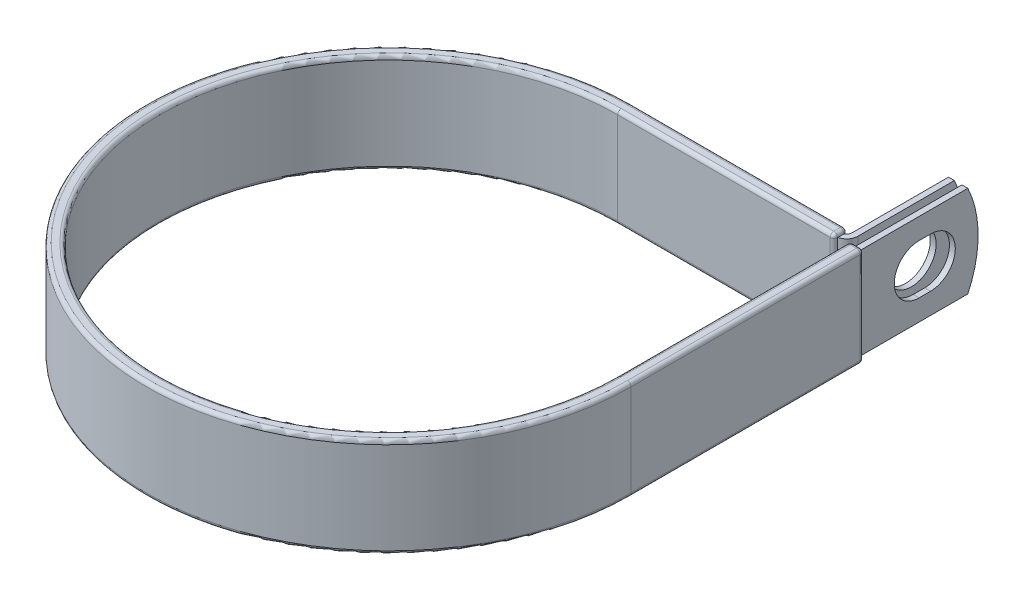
ISO-10303-21;
HEADER;
FILE_DESCRIPTION(('STEP AP214'),'2;1');
FILE_NAME('part.step','',(''),(''),'','','');
FILE_SCHEMA(('AUTOMOTIVE_DESIGN { 1 0 10303 214 1 1 1 1 }'));
ENDSEC;
DATA;
#1=APPLICATION_CONTEXT('core data for automotive mechanical design processes');
#2=APPLICATION_PROTOCOL_DEFINITION('international standard','automotive_design',2000,#1);
#3=PRODUCT_CONTEXT('',#1,'mechanical');
#4=PRODUCT('Part','Part','',(#3));
#5=PRODUCT_RELATED_PRODUCT_CATEGORY('part','',(#4));
#6=PRODUCT_DEFINITION_FORMATION('','',#4);
#7=PRODUCT_DEFINITION_CONTEXT('part definition',#1,'design');
#8=PRODUCT_DEFINITION('design','',#6,#7);
#9=PRODUCT_DEFINITION_SHAPE('','',#8);
#10=(LENGTH_UNIT() NAMED_UNIT(*) SI_UNIT(.MILLI.,.METRE.));
#11=(NAMED_UNIT(*) PLANE_ANGLE_UNIT() SI_UNIT($,.RADIAN.));
#12=(NAMED_UNIT(*) SI_UNIT($,.STERADIAN.) SOLID_ANGLE_UNIT());
#13=UNCERTAINTY_MEASURE_WITH_UNIT(LENGTH_MEASURE(1.E-05),#10,'distance_accuracy_value','');
#14=(GEOMETRIC_REPRESENTATION_CONTEXT(3) GLOBAL_UNCERTAINTY_ASSIGNED_CONTEXT((#13)) GLOBAL_UNIT_ASSIGNED_CONTEXT((#10,
#11,#12)) REPRESENTATION_CONTEXT('',''));
#15=CARTESIAN_POINT('',(0.,0.,0.));
#16=DIRECTION('',(0.,0.,1.));
#17=DIRECTION('',(1.,0.,0.));
#18=AXIS2_PLACEMENT_3D('',#15,#16,#17);
#19=CARTESIAN_POINT('',(46.84395,9.525,-72.9996));
#20=DIRECTION('',(1.,0.,0.));
#21=DIRECTION('',(0.,0.,-1.));
#22=AXIS2_PLACEMENT_3D('',#19,#20,#21);
#23=PLANE('',#22);
#24=CARTESIAN_POINT('',(46.84395,0.,-61.8998));
#25=DIRECTION('',(1.,0.,0.));
#26=DIRECTION('',(0.,0.,-1.));
#27=AXIS2_PLACEMENT_3D('',#24,#25,#26);
#28=CIRCLE('',#27,5.1562);
#29=CARTESIAN_POINT('',(46.84395,0.,-67.056));
#30=VERTEX_POINT('',#29);
#31=EDGE_CURVE('E460',#30,#30,#28,.F.);
#32=ORIENTED_EDGE('',*,*,#31,.T.);
#33=EDGE_LOOP('',(#32));
#34=FACE_BOUND('',#33,.T.);
#35=DIRECTION('',(0.,0.,1.));
#36=VECTOR('',#35,1.);
#37=CARTESIAN_POINT('',(46.84395,-9.525,-72.9996));
#38=LINE('',#37,#36);
#39=CARTESIAN_POINT('',(46.84395,-9.525,-70.8550631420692));
#40=VERTEX_POINT('',#39);
#41=CARTESIAN_POINT('',(46.84395,-9.525,-50.79619));
#42=VERTEX_POINT('',#41);
#43=EDGE_CURVE('E482',#40,#42,#38,.T.);
#44=ORIENTED_EDGE('',*,*,#43,.F.);
#45=CARTESIAN_POINT('',(46.84395,0.,-50.7746));
#46=DIRECTION('',(1.,0.,0.));
#47=DIRECTION('',(0.,0.,-1.));
#48=AXIS2_PLACEMENT_3D('',#45,#46,#47);
#49=CIRCLE('',#48,22.225);
#50=CARTESIAN_POINT('',(46.84395,9.525,-70.8550631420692));
#51=VERTEX_POINT('',#50);
#52=EDGE_CURVE('E419',#40,#51,#49,.T.);
#53=ORIENTED_EDGE('',*,*,#52,.T.);
#54=DIRECTION('',(0.,0.,1.));
#55=VECTOR('',#54,1.);
#56=CARTESIAN_POINT('',(46.84395,9.525,-72.9996));
#57=LINE('',#56,#55);
#58=CARTESIAN_POINT('',(46.84395,9.525,-50.79619));
#59=VERTEX_POINT('',#58);
#60=EDGE_CURVE('E472',#51,#59,#57,.T.);
#61=ORIENTED_EDGE('',*,*,#60,.T.);
#62=DIRECTION('',(0.,-1.,0.));
#63=VECTOR('',#62,1.);
#64=CARTESIAN_POINT('',(46.84395,9.525,-50.79619));
#65=LINE('',#64,#63);
#66=EDGE_CURVE('E489',#59,#42,#65,.T.);
#67=ORIENTED_EDGE('',*,*,#66,.T.);
#68=EDGE_LOOP('',(#44,#53,#61,#67));
#69=FACE_BOUND('',#68,.T.);
#70=ADVANCED_FACE('F54',(#34,#69),#23,.T.);
#71=CARTESIAN_POINT('',(45.62475,9.525,-72.9996));
#72=DIRECTION('',(1.,0.,0.));
#73=DIRECTION('',(0.,0.,-1.));
#74=AXIS2_PLACEMENT_3D('',#71,#72,#73);
#75=PLANE('',#74);
#76=CARTESIAN_POINT('',(45.62475,0.,-61.8998));
#77=DIRECTION('',(-1.,0.,0.));
#78=DIRECTION('',(0.,0.,1.));
#79=AXIS2_PLACEMENT_3D('',#76,#77,#78);
#80=CIRCLE('',#79,5.1562);
#81=CARTESIAN_POINT('',(45.62475,0.,-56.7436));
#82=VERTEX_POINT('',#81);
#83=EDGE_CURVE('E457',#82,#82,#80,.T.);
#84=ORIENTED_EDGE('',*,*,#83,.F.);
#85=EDGE_LOOP('',(#84));
#86=FACE_BOUND('',#85,.T.);
#87=CARTESIAN_POINT('',(45.62475,0.,-50.7746));
#88=DIRECTION('',(-1.,0.,0.));
#89=DIRECTION('',(0.,0.,1.));
#90=AXIS2_PLACEMENT_3D('',#87,#88,#89);
#91=CIRCLE('',#90,22.225);
#92=CARTESIAN_POINT('',(45.62475,9.525,-70.8550631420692));
#93=VERTEX_POINT('',#92);
#94=CARTESIAN_POINT('',(45.62475,-9.525,-70.8550631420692));
#95=VERTEX_POINT('',#94);
#96=EDGE_CURVE('E411',#93,#95,#91,.T.);
#97=ORIENTED_EDGE('',*,*,#96,.T.);
#98=DIRECTION('',(0.,0.,1.));
#99=VECTOR('',#98,1.);
#100=CARTESIAN_POINT('',(45.62475,-9.525,-72.9996));
#101=LINE('',#100,#99);
#102=CARTESIAN_POINT('',(45.62475,-9.525,-50.79619));
#103=VERTEX_POINT('',#102);
#104=EDGE_CURVE('E484',#95,#103,#101,.T.);
#105=ORIENTED_EDGE('',*,*,#104,.T.);
#106=DIRECTION('',(0.,-1.,0.));
#107=VECTOR('',#106,1.);
#108=CARTESIAN_POINT('',(45.62475,9.525,-50.79619));
#109=LINE('',#108,#107);
#110=CARTESIAN_POINT('',(45.62475,9.525,-50.79619));
#111=VERTEX_POINT('',#110);
#112=EDGE_CURVE('E477',#111,#103,#109,.T.);
#113=ORIENTED_EDGE('',*,*,#112,.F.);
#114=DIRECTION('',(0.,0.,1.));
#115=VECTOR('',#114,1.);
#116=CARTESIAN_POINT('',(45.62475,9.525,-72.9996));
#117=LINE('',#116,#115);
#118=EDGE_CURVE('E474',#93,#111,#117,.T.);
#119=ORIENTED_EDGE('',*,*,#118,.F.);
#120=EDGE_LOOP('',(#97,#105,#113,#119));
#121=FACE_BOUND('',#120,.T.);
#122=ADVANCED_FACE('F788',(#86,#121),#75,.F.);
#123=CARTESIAN_POINT('',(0.,-9.525,0.));
#124=DIRECTION('',(0.,1.,0.));
#125=DIRECTION('',(1.,0.,0.));
#126=AXIS2_PLACEMENT_3D('',#123,#124,#125);
#127=PLANE('',#126);
#128=CARTESIAN_POINT('',(44.46651,-9.525,-50.79619));
#129=DIRECTION('',(0.,-1.,0.));
#130=DIRECTION('',(0.,0.,1.));
#131=AXIS2_PLACEMENT_3D('',#128,#129,#130);
#132=CIRCLE('',#131,2.37744);
#133=CARTESIAN_POINT('',(44.9897500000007,-9.525,-48.4770434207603));
#134=VERTEX_POINT('',#133);
#135=EDGE_CURVE('E479',#42,#134,#132,.T.);
#136=ORIENTED_EDGE('',*,*,#135,.T.);
#137=DIRECTION('',(0.,0.,-1.));
#138=VECTOR('',#137,1.);
#139=CARTESIAN_POINT('',(44.9897500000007,-9.525,-49.63795));
#140=LINE('',#139,#138);
#141=CARTESIAN_POINT('',(44.9897500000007,-9.525,-49.6697));
#142=VERTEX_POINT('',#141);
#143=EDGE_CURVE('E368',#134,#142,#140,.T.);
#144=ORIENTED_EDGE('',*,*,#143,.T.);
#145=CARTESIAN_POINT('',(44.2277500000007,-9.525,-49.6697));
#146=DIRECTION('',(0.,1.,0.));
#147=DIRECTION('',(0.,0.,1.));
#148=AXIS2_PLACEMENT_3D('',#145,#146,#147);
#149=CIRCLE('',#148,0.762);
#150=CARTESIAN_POINT('',(44.9843610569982,-9.525,-49.7601638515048));
#151=VERTEX_POINT('',#150);
#152=EDGE_CURVE('E554',#142,#151,#149,.T.);
#153=ORIENTED_EDGE('',*,*,#152,.T.);
#154=CARTESIAN_POINT('',(44.46651,-9.525,-50.79619));
#155=DIRECTION('',(0.,1.,0.));
#156=DIRECTION('',(1.,0.,0.));
#157=AXIS2_PLACEMENT_3D('',#154,#155,#156);
#158=CIRCLE('',#157,1.15824);
#159=EDGE_CURVE('E77',#103,#151,#158,.F.);
#160=ORIENTED_EDGE('',*,*,#159,.F.);
#161=ORIENTED_EDGE('',*,*,#104,.F.);
#162=DIRECTION('',(-1.,0.,0.));
#163=VECTOR('',#162,1.);
#164=CARTESIAN_POINT('',(49.63795,-9.525,-70.8550631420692));
#165=LINE('',#164,#163);
#166=EDGE_CURVE('E498',#40,#95,#165,.T.);
#167=ORIENTED_EDGE('',*,*,#166,.F.);
#168=ORIENTED_EDGE('',*,*,#43,.T.);
#169=EDGE_LOOP('',(#136,#144,#153,#160,#161,#167,#168));
#170=FACE_BOUND('',#169,.T.);
#171=ADVANCED_FACE('F794',(#170),#127,.F.);
#172=CARTESIAN_POINT('',(0.,9.525,0.));
#173=DIRECTION('',(0.,1.,0.));
#174=DIRECTION('',(1.,0.,0.));
#175=AXIS2_PLACEMENT_3D('',#172,#173,#174);
#176=PLANE('',#175);
#177=DIRECTION('',(0.,0.,-1.));
#178=VECTOR('',#177,1.);
#179=CARTESIAN_POINT('',(44.98975,9.525,6.31078317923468E-13));
#180=LINE('',#179,#178);
#181=CARTESIAN_POINT('',(44.9897500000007,9.525,-48.4770434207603));
#182=VERTEX_POINT('',#181);
#183=CARTESIAN_POINT('',(44.9897500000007,9.525,-49.6697));
#184=VERTEX_POINT('',#183);
#185=EDGE_CURVE('E405',#182,#184,#180,.T.);
#186=ORIENTED_EDGE('',*,*,#185,.F.);
#187=CARTESIAN_POINT('',(44.46651,9.525,-50.79619));
#188=DIRECTION('',(0.,-1.,0.));
#189=DIRECTION('',(0.,0.,1.));
#190=AXIS2_PLACEMENT_3D('',#187,#188,#189);
#191=CIRCLE('',#190,2.37744);
#192=EDGE_CURVE('E469',#59,#182,#191,.T.);
#193=ORIENTED_EDGE('',*,*,#192,.F.);
#194=ORIENTED_EDGE('',*,*,#60,.F.);
#195=DIRECTION('',(-1.,0.,0.));
#196=VECTOR('',#195,1.);
#197=CARTESIAN_POINT('',(49.63795,9.525,-70.8550631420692));
#198=LINE('',#197,#196);
#199=EDGE_CURVE('E495',#51,#93,#198,.T.);
#200=ORIENTED_EDGE('',*,*,#199,.T.);
#201=ORIENTED_EDGE('',*,*,#118,.T.);
#202=CARTESIAN_POINT('',(44.46651,9.525,-50.79619));
#203=DIRECTION('',(0.,1.,0.));
#204=DIRECTION('',(1.,0.,0.));
#205=AXIS2_PLACEMENT_3D('',#202,#203,#204);
#206=CIRCLE('',#205,1.15824);
#207=CARTESIAN_POINT('',(44.9843610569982,9.525,-49.7601638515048));
#208=VERTEX_POINT('',#207);
#209=EDGE_CURVE('E70',#111,#208,#206,.F.);
#210=ORIENTED_EDGE('',*,*,#209,.T.);
#211=CARTESIAN_POINT('',(44.2277500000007,9.525,-49.6697));
#212=DIRECTION('',(0.,1.,0.));
#213=DIRECTION('',(0.,0.,1.));
#214=AXIS2_PLACEMENT_3D('',#211,#212,#213);
#215=CIRCLE('',#214,0.762);
#216=EDGE_CURVE('E12',#208,#184,#215,.F.);
#217=ORIENTED_EDGE('',*,*,#216,.T.);
#218=EDGE_LOOP('',(#186,#193,#194,#200,#201,#210,#217));
#219=FACE_BOUND('',#218,.T.);
#220=ADVANCED_FACE('F802',(#219),#176,.T.);
#221=CARTESIAN_POINT('',(44.46651,9.525,-50.79619));
#222=DIRECTION('',(0.,-1.,0.));
#223=DIRECTION('',(0.,0.,-1.));
#224=AXIS2_PLACEMENT_3D('',#221,#222,#223);
#225=CYLINDRICAL_SURFACE('',#224,2.37744);
#226=ORIENTED_EDGE('',*,*,#135,.F.);
#227=ORIENTED_EDGE('',*,*,#66,.F.);
#228=ORIENTED_EDGE('',*,*,#192,.T.);
#229=CARTESIAN_POINT('',(44.46651,9.525,-50.79619));
#230=DIRECTION('',(0.,-1.,0.));
#231=DIRECTION('',(0.,0.,-1.));
#232=AXIS2_PLACEMENT_3D('',#229,#230,#231);
#233=CIRCLE('',#232,2.37744);
#234=CARTESIAN_POINT('',(44.46651,9.525,-48.41875));
#235=VERTEX_POINT('',#234);
#236=EDGE_CURVE('E402',#235,#182,#233,.F.);
#237=ORIENTED_EDGE('',*,*,#236,.F.);
#238=DIRECTION('',(0.,-1.,0.));
#239=VECTOR('',#238,1.);
#240=CARTESIAN_POINT('',(44.46651,9.525,-48.41875));
#241=LINE('',#240,#239);
#242=CARTESIAN_POINT('',(44.46651,-9.52499999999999,-48.41875));
#243=VERTEX_POINT('',#242);
#244=EDGE_CURVE('E492',#235,#243,#241,.T.);
#245=ORIENTED_EDGE('',*,*,#244,.T.);
#246=CARTESIAN_POINT('',(44.46651,-9.52499999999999,-50.79619));
#247=DIRECTION('',(0.,1.,0.));
#248=DIRECTION('',(-1.,0.,0.));
#249=AXIS2_PLACEMENT_3D('',#246,#247,#248);
#250=CIRCLE('',#249,2.37744);
#251=EDGE_CURVE('E400',#134,#243,#250,.F.);
#252=ORIENTED_EDGE('',*,*,#251,.F.);
#253=EDGE_LOOP('',(#226,#227,#228,#237,#245,#252));
#254=FACE_BOUND('',#253,.T.);
#255=ADVANCED_FACE('F799',(#254),#225,.T.);
#256=CARTESIAN_POINT('',(44.46651,9.525,-50.79619));
#257=DIRECTION('',(0.,-1.,0.));
#258=DIRECTION('',(0.,0.,-1.));
#259=AXIS2_PLACEMENT_3D('',#256,#257,#258);
#260=CYLINDRICAL_SURFACE('',#259,1.15824);
#261=ORIENTED_EDGE('',*,*,#159,.T.);
#262=DIRECTION('',(0.,1.,0.));
#263=VECTOR('',#262,1.);
#264=CARTESIAN_POINT('',(44.9843610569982,-9.525,-49.7601638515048));
#265=LINE('',#264,#263);
#266=EDGE_CURVE('E63',#151,#208,#265,.T.);
#267=ORIENTED_EDGE('',*,*,#266,.T.);
#268=ORIENTED_EDGE('',*,*,#209,.F.);
#269=ORIENTED_EDGE('',*,*,#112,.T.);
#270=EDGE_LOOP('',(#261,#267,#268,#269));
#271=FACE_BOUND('',#270,.T.);
#272=ADVANCED_FACE('F801',(#271),#260,.F.);
#273=CARTESIAN_POINT('',(61.4278859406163,0.,-61.8998));
#274=DIRECTION('',(-1.,0.,0.));
#275=DIRECTION('',(0.,0.,1.));
#276=AXIS2_PLACEMENT_3D('',#273,#274,#275);
#277=CYLINDRICAL_SURFACE('',#276,5.1562);
#278=ORIENTED_EDGE('',*,*,#83,.T.);
#279=EDGE_LOOP('',(#278));
#280=FACE_BOUND('',#279,.T.);
#281=ORIENTED_EDGE('',*,*,#31,.F.);
#282=EDGE_LOOP('',(#281));
#283=FACE_BOUND('',#282,.T.);
#284=ADVANCED_FACE('F808',(#280,#283),#277,.F.);
#285=CARTESIAN_POINT('',(49.63795,0.,-50.7746));
#286=DIRECTION('',(-1.,0.,0.));
#287=DIRECTION('',(0.,0.,1.));
#288=AXIS2_PLACEMENT_3D('',#285,#286,#287);
#289=CYLINDRICAL_SURFACE('',#288,22.225);
#290=ORIENTED_EDGE('',*,*,#52,.F.);
#291=ORIENTED_EDGE('',*,*,#166,.T.);
#292=ORIENTED_EDGE('',*,*,#96,.F.);
#293=ORIENTED_EDGE('',*,*,#199,.F.);
#294=EDGE_LOOP('',(#290,#291,#292,#293));
#295=FACE_BOUND('',#294,.T.);
#296=ADVANCED_FACE('F859',(#295),#289,.T.);
#297=CARTESIAN_POINT('',(6.79177441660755E-13,-9.525,-48.41875));
#298=DIRECTION('',(0.,0.,1.));
#299=DIRECTION('',(1.,0.,0.));
#300=AXIS2_PLACEMENT_3D('',#297,#298,#299);
#301=PLANE('',#300);
#302=DIRECTION('',(1.,0.,0.));
#303=VECTOR('',#302,1.);
#304=CARTESIAN_POINT('',(6.79177441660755E-13,-9.525,-48.41875));
#305=LINE('',#304,#303);
#306=CARTESIAN_POINT('',(44.9897500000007,-9.525,-48.41875));
#307=VERTEX_POINT('',#306);
#308=EDGE_CURVE('E375',#243,#307,#305,.T.);
#309=ORIENTED_EDGE('',*,*,#308,.F.);
#310=ORIENTED_EDGE('',*,*,#244,.F.);
#311=DIRECTION('',(1.,0.,0.));
#312=VECTOR('',#311,1.);
#313=CARTESIAN_POINT('',(6.79177441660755E-13,9.525,-48.41875));
#314=LINE('',#313,#312);
#315=CARTESIAN_POINT('',(44.9897500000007,9.525,-48.41875));
#316=VERTEX_POINT('',#315);
#317=EDGE_CURVE('E377',#235,#316,#314,.T.);
#318=ORIENTED_EDGE('',*,*,#317,.T.);
#319=DIRECTION('',(0.,-1.,0.));
#320=VECTOR('',#319,1.);
#321=CARTESIAN_POINT('',(44.9897500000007,-9.525,-48.41875));
#322=LINE('',#321,#320);
#323=EDGE_CURVE('E307',#316,#307,#322,.T.);
#324=ORIENTED_EDGE('',*,*,#323,.T.);
#325=EDGE_LOOP('',(#309,#310,#318,#324));
#326=FACE_BOUND('',#325,.T.);
#327=ADVANCED_FACE('F831',(#326),#301,.F.);
#328=CARTESIAN_POINT('',(44.9897500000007,-9.55675,-48.387));
#329=DIRECTION('',(1.,0.,0.));
#330=DIRECTION('',(0.,0.,-1.));
#331=AXIS2_PLACEMENT_3D('',#328,#329,#330);
#332=PLANE('',#331);
#333=DIRECTION('',(0.,0.,-1.));
#334=VECTOR('',#333,1.);
#335=CARTESIAN_POINT('',(44.9897500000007,-9.55674999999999,-49.6697));
#336=LINE('',#335,#334);
#337=CARTESIAN_POINT('',(44.9897500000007,-9.55675,-48.387));
#338=VERTEX_POINT('',#337);
#339=CARTESIAN_POINT('',(44.9897500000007,-9.55674999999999,-49.6697));
#340=VERTEX_POINT('',#339);
#341=EDGE_CURVE('E508',#338,#340,#336,.T.);
#342=ORIENTED_EDGE('',*,*,#341,.T.);
#343=DIRECTION('',(0.,1.,0.));
#344=VECTOR('',#343,1.);
#345=CARTESIAN_POINT('',(44.9897500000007,-9.55675,-49.6697));
#346=LINE('',#345,#344);
#347=EDGE_CURVE('E512',#340,#142,#346,.T.);
#348=ORIENTED_EDGE('',*,*,#347,.T.);
#349=ORIENTED_EDGE('',*,*,#143,.F.);
#350=EDGE_CURVE('E369',#307,#134,#140,.T.);
#351=ORIENTED_EDGE('',*,*,#350,.F.);
#352=ORIENTED_EDGE('',*,*,#323,.F.);
#353=DIRECTION('',(0.,0.,1.));
#354=VECTOR('',#353,1.);
#355=CARTESIAN_POINT('',(44.9897500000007,9.525,-48.41875));
#356=LINE('',#355,#354);
#357=EDGE_CURVE('E372',#182,#316,#356,.T.);
#358=ORIENTED_EDGE('',*,*,#357,.F.);
#359=ORIENTED_EDGE('',*,*,#185,.T.);
#360=DIRECTION('',(0.,1.,0.));
#361=VECTOR('',#360,1.);
#362=CARTESIAN_POINT('',(44.9897500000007,-9.55675,-49.6697));
#363=LINE('',#362,#361);
#364=CARTESIAN_POINT('',(44.9897500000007,9.55675,-49.6697));
#365=VERTEX_POINT('',#364);
#366=EDGE_CURVE('E510',#184,#365,#363,.T.);
#367=ORIENTED_EDGE('',*,*,#366,.T.);
#368=DIRECTION('',(0.,0.,1.));
#369=VECTOR('',#368,1.);
#370=CARTESIAN_POINT('',(44.9897500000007,9.55675,-48.387));
#371=LINE('',#370,#369);
#372=CARTESIAN_POINT('',(44.9897500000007,9.55675,-48.387));
#373=VERTEX_POINT('',#372);
#374=EDGE_CURVE('E504',#365,#373,#371,.T.);
#375=ORIENTED_EDGE('',*,*,#374,.T.);
#376=DIRECTION('',(0.,-1.,0.));
#377=VECTOR('',#376,1.);
#378=CARTESIAN_POINT('',(44.9897500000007,-9.55675,-48.387));
#379=LINE('',#378,#377);
#380=EDGE_CURVE('E506',#373,#338,#379,.T.);
#381=ORIENTED_EDGE('',*,*,#380,.T.);
#382=EDGE_LOOP('',(#342,#348,#349,#351,#352,#358,#359,#367,#375,#381));
#383=FACE_BOUND('',#382,.T.);
#384=ADVANCED_FACE('F827',(#383),#332,.T.);
#385=CARTESIAN_POINT('',(6.96724714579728E-13,-9.55675,-49.6697));
#386=DIRECTION('',(1.,0.,0.));
#387=DIRECTION('',(0.,0.,-1.));
#388=AXIS2_PLACEMENT_3D('',#385,#386,#387);
#389=CYLINDRICAL_SURFACE('',#388,0.762000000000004);
#390=DIRECTION('',(1.,0.,0.));
#391=VECTOR('',#390,1.);
#392=CARTESIAN_POINT('',(7.07413408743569E-13,-9.55675,-50.4317));
#393=LINE('',#392,#391);
#394=CARTESIAN_POINT('',(7.07413408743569E-13,-9.55675,-50.4317));
#395=VERTEX_POINT('',#394);
#396=CARTESIAN_POINT('',(44.2277500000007,-9.55675,-50.4317));
#397=VERTEX_POINT('',#396);
#398=EDGE_CURVE('E394',#395,#397,#393,.T.);
#399=ORIENTED_EDGE('',*,*,#398,.T.);
#400=CARTESIAN_POINT('',(44.2277500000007,-9.55675,-49.6697));
#401=DIRECTION('',(1.,0.,0.));
#402=DIRECTION('',(0.,0.,-1.));
#403=AXIS2_PLACEMENT_3D('',#400,#401,#402);
#404=CIRCLE('',#403,0.762000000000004);
#405=CARTESIAN_POINT('',(44.2277500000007,-10.31875,-49.6697));
#406=VERTEX_POINT('',#405);
#407=EDGE_CURVE('E517',#397,#406,#404,.F.);
#408=ORIENTED_EDGE('',*,*,#407,.T.);
#409=DIRECTION('',(1.,0.,0.));
#410=VECTOR('',#409,1.);
#411=CARTESIAN_POINT('',(6.96724714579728E-13,-10.31875,-49.6697));
#412=LINE('',#411,#410);
#413=CARTESIAN_POINT('',(6.96724714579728E-13,-10.31875,-49.6697));
#414=VERTEX_POINT('',#413);
#415=EDGE_CURVE('E397',#414,#406,#412,.T.);
#416=ORIENTED_EDGE('',*,*,#415,.F.);
#417=CARTESIAN_POINT('',(6.96724714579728E-13,-9.55675,-49.6697));
#418=DIRECTION('',(1.,0.,0.));
#419=DIRECTION('',(0.,0.,1.));
#420=AXIS2_PLACEMENT_3D('',#417,#418,#419);
#421=CIRCLE('',#420,0.762000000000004);
#422=EDGE_CURVE('E345',#414,#395,#421,.T.);
#423=ORIENTED_EDGE('',*,*,#422,.T.);
#424=EDGE_LOOP('',(#399,#408,#416,#423));
#425=FACE_BOUND('',#424,.T.);
#426=ADVANCED_FACE('F670',(#425),#389,.T.);
#427=CARTESIAN_POINT('',(7.07413408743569E-13,9.55675,-50.4317));
#428=DIRECTION('',(0.,0.,-1.));
#429=DIRECTION('',(0.,1.,0.));
#430=AXIS2_PLACEMENT_3D('',#427,#428,#429);
#431=PLANE('',#430);
#432=DIRECTION('',(1.,0.,0.));
#433=VECTOR('',#432,1.);
#434=CARTESIAN_POINT('',(7.07413408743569E-13,9.55675,-50.4317));
#435=LINE('',#434,#433);
#436=CARTESIAN_POINT('',(7.07413408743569E-13,9.55675,-50.4317));
#437=VERTEX_POINT('',#436);
#438=CARTESIAN_POINT('',(44.2277500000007,9.55675,-50.4317));
#439=VERTEX_POINT('',#438);
#440=EDGE_CURVE('E391',#437,#439,#435,.T.);
#441=ORIENTED_EDGE('',*,*,#440,.T.);
#442=DIRECTION('',(0.,1.,0.));
#443=VECTOR('',#442,1.);
#444=CARTESIAN_POINT('',(44.2277500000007,9.55675,-50.4317));
#445=LINE('',#444,#443);
#446=EDGE_CURVE('E515',#439,#397,#445,.F.);
#447=ORIENTED_EDGE('',*,*,#446,.T.);
#448=ORIENTED_EDGE('',*,*,#398,.F.);
#449=DIRECTION('',(0.,1.,0.));
#450=VECTOR('',#449,1.);
#451=CARTESIAN_POINT('',(7.07413408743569E-13,9.55675,-50.4317));
#452=LINE('',#451,#450);
#453=EDGE_CURVE('E342',#395,#437,#452,.T.);
#454=ORIENTED_EDGE('',*,*,#453,.T.);
#455=EDGE_LOOP('',(#441,#447,#448,#454));
#456=FACE_BOUND('',#455,.T.);
#457=ADVANCED_FACE('F676',(#456),#431,.T.);
#458=CARTESIAN_POINT('',(6.96724714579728E-13,9.55675,-49.6697));
#459=DIRECTION('',(1.,0.,0.));
#460=DIRECTION('',(0.,0.,-1.));
#461=AXIS2_PLACEMENT_3D('',#458,#459,#460);
#462=CYLINDRICAL_SURFACE('',#461,0.762);
#463=DIRECTION('',(1.,0.,0.));
#464=VECTOR('',#463,1.);
#465=CARTESIAN_POINT('',(6.96724714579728E-13,10.31875,-49.6697));
#466=LINE('',#465,#464);
#467=CARTESIAN_POINT('',(6.96724714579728E-13,10.31875,-49.6697));
#468=VERTEX_POINT('',#467);
#469=CARTESIAN_POINT('',(44.2277500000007,10.31875,-49.6697));
#470=VERTEX_POINT('',#469);
#471=EDGE_CURVE('E388',#468,#470,#466,.T.);
#472=ORIENTED_EDGE('',*,*,#471,.T.);
#473=CARTESIAN_POINT('',(44.2277500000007,9.55675,-49.6697));
#474=DIRECTION('',(1.,0.,0.));
#475=DIRECTION('',(0.,0.,-1.));
#476=AXIS2_PLACEMENT_3D('',#473,#474,#475);
#477=CIRCLE('',#476,0.762);
#478=EDGE_CURVE('E501',#470,#439,#477,.F.);
#479=ORIENTED_EDGE('',*,*,#478,.T.);
#480=ORIENTED_EDGE('',*,*,#440,.F.);
#481=CARTESIAN_POINT('',(6.96724714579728E-13,9.55675,-49.6697));
#482=DIRECTION('',(1.,0.,0.));
#483=DIRECTION('',(0.,0.,1.));
#484=AXIS2_PLACEMENT_3D('',#481,#482,#483);
#485=CIRCLE('',#484,0.762);
#486=EDGE_CURVE('E339',#437,#468,#485,.T.);
#487=ORIENTED_EDGE('',*,*,#486,.T.);
#488=EDGE_LOOP('',(#472,#479,#480,#487));
#489=FACE_BOUND('',#488,.T.);
#490=ADVANCED_FACE('F680',(#489),#462,.T.);
#491=CARTESIAN_POINT('',(6.78732079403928E-13,9.55675,-48.387));
#492=DIRECTION('',(1.,0.,0.));
#493=DIRECTION('',(0.,0.,-1.));
#494=AXIS2_PLACEMENT_3D('',#491,#492,#493);
#495=CYLINDRICAL_SURFACE('',#494,0.761999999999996);
#496=DIRECTION('',(1.,0.,0.));
#497=VECTOR('',#496,1.);
#498=CARTESIAN_POINT('',(6.68043385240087E-13,9.55675,-47.625));
#499=LINE('',#498,#497);
#500=CARTESIAN_POINT('',(6.68043385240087E-13,9.55675,-47.625));
#501=VERTEX_POINT('',#500);
#502=CARTESIAN_POINT('',(44.2277500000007,9.55675,-47.625));
#503=VERTEX_POINT('',#502);
#504=EDGE_CURVE('E382',#501,#503,#499,.T.);
#505=ORIENTED_EDGE('',*,*,#504,.T.);
#506=CARTESIAN_POINT('',(44.2277500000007,9.55675,-48.387));
#507=DIRECTION('',(1.,0.,0.));
#508=DIRECTION('',(0.,0.,-1.));
#509=AXIS2_PLACEMENT_3D('',#506,#507,#508);
#510=CIRCLE('',#509,0.761999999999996);
#511=CARTESIAN_POINT('',(44.2277500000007,10.31875,-48.387));
#512=VERTEX_POINT('',#511);
#513=EDGE_CURVE('E527',#503,#512,#510,.F.);
#514=ORIENTED_EDGE('',*,*,#513,.T.);
#515=DIRECTION('',(1.,0.,0.));
#516=VECTOR('',#515,1.);
#517=CARTESIAN_POINT('',(6.78732079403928E-13,10.31875,-48.387));
#518=LINE('',#517,#516);
#519=CARTESIAN_POINT('',(6.78732079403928E-13,10.31875,-48.387));
#520=VERTEX_POINT('',#519);
#521=EDGE_CURVE('E385',#520,#512,#518,.T.);
#522=ORIENTED_EDGE('',*,*,#521,.F.);
#523=CARTESIAN_POINT('',(6.78732079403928E-13,9.55675,-48.387));
#524=DIRECTION('',(1.,0.,0.));
#525=DIRECTION('',(0.,0.,1.));
#526=AXIS2_PLACEMENT_3D('',#523,#524,#525);
#527=CIRCLE('',#526,0.761999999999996);
#528=EDGE_CURVE('E336',#520,#501,#527,.T.);
#529=ORIENTED_EDGE('',*,*,#528,.T.);
#530=EDGE_LOOP('',(#505,#514,#522,#529));
#531=FACE_BOUND('',#530,.T.);
#532=ADVANCED_FACE('F721',(#531),#495,.T.);
#533=CARTESIAN_POINT('',(6.68043385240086E-13,-9.55675,-47.625));
#534=DIRECTION('',(0.,0.,1.));
#535=DIRECTION('',(0.,-1.,0.));
#536=AXIS2_PLACEMENT_3D('',#533,#534,#535);
#537=PLANE('',#536);
#538=DIRECTION('',(1.,0.,0.));
#539=VECTOR('',#538,1.);
#540=CARTESIAN_POINT('',(6.68043385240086E-13,-9.55675,-47.625));
#541=LINE('',#540,#539);
#542=CARTESIAN_POINT('',(6.68043385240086E-13,-9.55675,-47.625));
#543=VERTEX_POINT('',#542);
#544=CARTESIAN_POINT('',(44.2277500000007,-9.55675,-47.625));
#545=VERTEX_POINT('',#544);
#546=EDGE_CURVE('E379',#543,#545,#541,.T.);
#547=ORIENTED_EDGE('',*,*,#546,.T.);
#548=DIRECTION('',(0.,-1.,0.));
#549=VECTOR('',#548,1.);
#550=CARTESIAN_POINT('',(44.2277500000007,-9.55675,-47.625));
#551=LINE('',#550,#549);
#552=EDGE_CURVE('E525',#545,#503,#551,.F.);
#553=ORIENTED_EDGE('',*,*,#552,.T.);
#554=ORIENTED_EDGE('',*,*,#504,.F.);
#555=DIRECTION('',(0.,-1.,0.));
#556=VECTOR('',#555,1.);
#557=CARTESIAN_POINT('',(6.68043385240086E-13,-9.55675,-47.625));
#558=LINE('',#557,#556);
#559=EDGE_CURVE('E327',#501,#543,#558,.T.);
#560=ORIENTED_EDGE('',*,*,#559,.T.);
#561=EDGE_LOOP('',(#547,#553,#554,#560));
#562=FACE_BOUND('',#561,.T.);
#563=ADVANCED_FACE('F719',(#562),#537,.T.);
#564=CARTESIAN_POINT('',(6.78732079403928E-13,-9.55675,-48.387));
#565=DIRECTION('',(1.,0.,0.));
#566=DIRECTION('',(0.,0.,-1.));
#567=AXIS2_PLACEMENT_3D('',#564,#565,#566);
#568=CYLINDRICAL_SURFACE('',#567,0.762000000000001);
#569=DIRECTION('',(1.,0.,0.));
#570=VECTOR('',#569,1.);
#571=CARTESIAN_POINT('',(6.78732079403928E-13,-10.31875,-48.387));
#572=LINE('',#571,#570);
#573=CARTESIAN_POINT('',(6.78732079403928E-13,-10.31875,-48.387));
#574=VERTEX_POINT('',#573);
#575=CARTESIAN_POINT('',(44.2277500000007,-10.31875,-48.387));
#576=VERTEX_POINT('',#575);
#577=EDGE_CURVE('E303',#574,#576,#572,.T.);
#578=ORIENTED_EDGE('',*,*,#577,.T.);
#579=CARTESIAN_POINT('',(44.2277500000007,-9.55675,-48.387));
#580=DIRECTION('',(1.,0.,0.));
#581=DIRECTION('',(0.,0.,-1.));
#582=AXIS2_PLACEMENT_3D('',#579,#580,#581);
#583=CIRCLE('',#582,0.762000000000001);
#584=EDGE_CURVE('E523',#576,#545,#583,.F.);
#585=ORIENTED_EDGE('',*,*,#584,.T.);
#586=ORIENTED_EDGE('',*,*,#546,.F.);
#587=CARTESIAN_POINT('',(6.78732079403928E-13,-9.55675,-48.387));
#588=DIRECTION('',(1.,0.,0.));
#589=DIRECTION('',(0.,0.,-1.));
#590=AXIS2_PLACEMENT_3D('',#587,#588,#589);
#591=CIRCLE('',#590,0.762000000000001);
#592=EDGE_CURVE('E324',#543,#574,#591,.T.);
#593=ORIENTED_EDGE('',*,*,#592,.T.);
#594=EDGE_LOOP('',(#578,#585,#586,#593));
#595=FACE_BOUND('',#594,.T.);
#596=ADVANCED_FACE('F709',(#595),#568,.T.);
#597=CARTESIAN_POINT('',(0.,-9.55675,0.));
#598=DIRECTION('',(0.,-1.,0.));
#599=DIRECTION('',(0.,0.,-1.));
#600=AXIS2_PLACEMENT_3D('',#597,#598,#599);
#601=TOROIDAL_SURFACE('',#600,49.6697,0.762000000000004);
#602=CARTESIAN_POINT('',(49.6697,-9.55675,0.));
#603=DIRECTION('',(0.,0.,1.));
#604=DIRECTION('',(-1.,0.,0.));
#605=AXIS2_PLACEMENT_3D('',#602,#603,#604);
#606=CIRCLE('',#605,0.762000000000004);
#607=CARTESIAN_POINT('',(49.6697,-10.31875,0.));
#608=VERTEX_POINT('',#607);
#609=CARTESIAN_POINT('',(50.4317,-9.55675,0.));
#610=VERTEX_POINT('',#609);
#611=EDGE_CURVE('E318',#608,#610,#606,.T.);
#612=ORIENTED_EDGE('',*,*,#611,.T.);
#613=CARTESIAN_POINT('',(0.,-9.55674999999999,0.));
#614=DIRECTION('',(0.,-1.,0.));
#615=DIRECTION('',(0.,0.,-1.));
#616=AXIS2_PLACEMENT_3D('',#613,#614,#615);
#617=CIRCLE('',#616,50.4317);
#618=EDGE_CURVE('E361',#610,#395,#617,.T.);
#619=ORIENTED_EDGE('',*,*,#618,.T.);
#620=ORIENTED_EDGE('',*,*,#422,.F.);
#621=CARTESIAN_POINT('',(0.,-10.31875,0.));
#622=DIRECTION('',(0.,-1.,0.));
#623=DIRECTION('',(0.,0.,-1.));
#624=AXIS2_PLACEMENT_3D('',#621,#622,#623);
#625=CIRCLE('',#624,49.6697);
#626=EDGE_CURVE('E308',#608,#414,#625,.T.);
#627=ORIENTED_EDGE('',*,*,#626,.F.);
#628=EDGE_LOOP('',(#612,#619,#620,#627));
#629=FACE_BOUND('',#628,.T.);
#630=ADVANCED_FACE('F667',(#629),#601,.T.);
#631=CARTESIAN_POINT('',(0.,9.525,0.));
#632=DIRECTION('',(0.,-1.,0.));
#633=DIRECTION('',(0.,0.,-1.));
#634=AXIS2_PLACEMENT_3D('',#631,#632,#633);
#635=CYLINDRICAL_SURFACE('',#634,50.4317);
#636=DIRECTION('',(0.,1.,0.));
#637=VECTOR('',#636,1.);
#638=CARTESIAN_POINT('',(50.4317,9.55675,0.));
#639=LINE('',#638,#637);
#640=CARTESIAN_POINT('',(50.4317,9.55675,0.));
#641=VERTEX_POINT('',#640);
#642=EDGE_CURVE('E655',#610,#641,#639,.T.);
#643=ORIENTED_EDGE('',*,*,#642,.T.);
#644=CARTESIAN_POINT('',(0.,9.55675,0.));
#645=DIRECTION('',(0.,-1.,0.));
#646=DIRECTION('',(0.,0.,-1.));
#647=AXIS2_PLACEMENT_3D('',#644,#645,#646);
#648=CIRCLE('',#647,50.4317);
#649=EDGE_CURVE('E358',#641,#437,#648,.T.);
#650=ORIENTED_EDGE('',*,*,#649,.T.);
#651=ORIENTED_EDGE('',*,*,#453,.F.);
#652=ORIENTED_EDGE('',*,*,#618,.F.);
#653=EDGE_LOOP('',(#643,#650,#651,#652));
#654=FACE_BOUND('',#653,.T.);
#655=ADVANCED_FACE('F673',(#654),#635,.T.);
#656=CARTESIAN_POINT('',(0.,9.55675,0.));
#657=DIRECTION('',(0.,-1.,0.));
#658=DIRECTION('',(0.,0.,-1.));
#659=AXIS2_PLACEMENT_3D('',#656,#657,#658);
#660=TOROIDAL_SURFACE('',#659,49.6697,0.762);
#661=CARTESIAN_POINT('',(49.6697,9.55675,0.));
#662=DIRECTION('',(0.,0.,1.));
#663=DIRECTION('',(-1.,0.,0.));
#664=AXIS2_PLACEMENT_3D('',#661,#662,#663);
#665=CIRCLE('',#664,0.762);
#666=CARTESIAN_POINT('',(49.6697,10.31875,0.));
#667=VERTEX_POINT('',#666);
#668=EDGE_CURVE('E734',#641,#667,#665,.T.);
#669=ORIENTED_EDGE('',*,*,#668,.T.);
#670=CARTESIAN_POINT('',(0.,10.31875,0.));
#671=DIRECTION('',(0.,-1.,0.));
#672=DIRECTION('',(0.,0.,-1.));
#673=AXIS2_PLACEMENT_3D('',#670,#671,#672);
#674=CIRCLE('',#673,49.6697);
#675=EDGE_CURVE('E355',#667,#468,#674,.T.);
#676=ORIENTED_EDGE('',*,*,#675,.T.);
#677=ORIENTED_EDGE('',*,*,#486,.F.);
#678=ORIENTED_EDGE('',*,*,#649,.F.);
#679=EDGE_LOOP('',(#669,#676,#677,#678));
#680=FACE_BOUND('',#679,.T.);
#681=ADVANCED_FACE('F678',(#680),#660,.T.);
#682=CARTESIAN_POINT('',(0.,9.55675,0.));
#683=DIRECTION('',(0.,-1.,0.));
#684=DIRECTION('',(0.,0.,-1.));
#685=AXIS2_PLACEMENT_3D('',#682,#683,#684);
#686=TOROIDAL_SURFACE('',#685,48.387,0.761999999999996);
#687=CARTESIAN_POINT('',(48.387,9.55675,0.));
#688=DIRECTION('',(0.,0.,1.));
#689=DIRECTION('',(-1.,0.,0.));
#690=AXIS2_PLACEMENT_3D('',#687,#688,#689);
#691=CIRCLE('',#690,0.761999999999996);
#692=CARTESIAN_POINT('',(48.387,10.31875,0.));
#693=VERTEX_POINT('',#692);
#694=CARTESIAN_POINT('',(47.625,9.55675,0.));
#695=VERTEX_POINT('',#694);
#696=EDGE_CURVE('E730',#693,#695,#691,.T.);
#697=ORIENTED_EDGE('',*,*,#696,.T.);
#698=CARTESIAN_POINT('',(0.,9.55675,0.));
#699=DIRECTION('',(0.,-1.,0.));
#700=DIRECTION('',(0.,0.,-1.));
#701=AXIS2_PLACEMENT_3D('',#698,#699,#700);
#702=CIRCLE('',#701,47.625);
#703=EDGE_CURVE('E349',#695,#501,#702,.T.);
#704=ORIENTED_EDGE('',*,*,#703,.T.);
#705=ORIENTED_EDGE('',*,*,#528,.F.);
#706=CARTESIAN_POINT('',(0.,10.31875,0.));
#707=DIRECTION('',(0.,-1.,0.));
#708=DIRECTION('',(0.,0.,-1.));
#709=AXIS2_PLACEMENT_3D('',#706,#707,#708);
#710=CIRCLE('',#709,48.387);
#711=EDGE_CURVE('E352',#693,#520,#710,.T.);
#712=ORIENTED_EDGE('',*,*,#711,.F.);
#713=EDGE_LOOP('',(#697,#704,#705,#712));
#714=FACE_BOUND('',#713,.T.);
#715=ADVANCED_FACE('F728',(#714),#686,.T.);
#716=CARTESIAN_POINT('',(0.,9.525,0.));
#717=DIRECTION('',(0.,-1.,0.));
#718=DIRECTION('',(0.,0.,-1.));
#719=AXIS2_PLACEMENT_3D('',#716,#717,#718);
#720=CYLINDRICAL_SURFACE('',#719,47.625);
#721=DIRECTION('',(0.,-1.,0.));
#722=VECTOR('',#721,1.);
#723=CARTESIAN_POINT('',(47.625,-9.55675,0.));
#724=LINE('',#723,#722);
#725=CARTESIAN_POINT('',(47.625,-9.55675,0.));
#726=VERTEX_POINT('',#725);
#727=EDGE_CURVE('E733',#695,#726,#724,.T.);
#728=ORIENTED_EDGE('',*,*,#727,.T.);
#729=CARTESIAN_POINT('',(0.,-9.55675,0.));
#730=DIRECTION('',(0.,-1.,0.));
#731=DIRECTION('',(0.,0.,-1.));
#732=AXIS2_PLACEMENT_3D('',#729,#730,#731);
#733=CIRCLE('',#732,47.625);
#734=EDGE_CURVE('E314',#726,#543,#733,.T.);
#735=ORIENTED_EDGE('',*,*,#734,.T.);
#736=ORIENTED_EDGE('',*,*,#559,.F.);
#737=ORIENTED_EDGE('',*,*,#703,.F.);
#738=EDGE_LOOP('',(#728,#735,#736,#737));
#739=FACE_BOUND('',#738,.T.);
#740=ADVANCED_FACE('F726',(#739),#720,.F.);
#741=CARTESIAN_POINT('',(0.,-9.55675,0.));
#742=DIRECTION('',(0.,-1.,0.));
#743=DIRECTION('',(0.,0.,-1.));
#744=AXIS2_PLACEMENT_3D('',#741,#742,#743);
#745=TOROIDAL_SURFACE('',#744,48.387,0.762000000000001);
#746=CARTESIAN_POINT('',(48.387,-9.55675,0.));
#747=DIRECTION('',(0.,0.,1.));
#748=DIRECTION('',(1.,0.,0.));
#749=AXIS2_PLACEMENT_3D('',#746,#747,#748);
#750=CIRCLE('',#749,0.762000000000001);
#751=CARTESIAN_POINT('',(48.387,-10.31875,0.));
#752=VERTEX_POINT('',#751);
#753=EDGE_CURVE('E311',#726,#752,#750,.T.);
#754=ORIENTED_EDGE('',*,*,#753,.T.);
#755=CARTESIAN_POINT('',(0.,-10.31875,0.));
#756=DIRECTION('',(0.,-1.,0.));
#757=DIRECTION('',(0.,0.,-1.));
#758=AXIS2_PLACEMENT_3D('',#755,#756,#757);
#759=CIRCLE('',#758,48.387);
#760=EDGE_CURVE('E295',#752,#574,#759,.T.);
#761=ORIENTED_EDGE('',*,*,#760,.T.);
#762=ORIENTED_EDGE('',*,*,#592,.F.);
#763=ORIENTED_EDGE('',*,*,#734,.F.);
#764=EDGE_LOOP('',(#754,#761,#762,#763));
#765=FACE_BOUND('',#764,.T.);
#766=ADVANCED_FACE('F312',(#765),#745,.T.);
#767=CARTESIAN_POINT('',(48.387,-9.55675,0.));
#768=DIRECTION('',(0.,0.,-1.));
#769=DIRECTION('',(-1.,0.,0.));
#770=AXIS2_PLACEMENT_3D('',#767,#768,#769);
#771=CYLINDRICAL_SURFACE('',#770,0.762000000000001);
#772=DIRECTION('',(0.,0.,-1.));
#773=VECTOR('',#772,1.);
#774=CARTESIAN_POINT('',(47.625,-9.55675,0.));
#775=LINE('',#774,#773);
#776=CARTESIAN_POINT('',(47.625,-9.55675,-47.65675));
#777=VERTEX_POINT('',#776);
#778=EDGE_CURVE('E741',#726,#777,#775,.T.);
#779=ORIENTED_EDGE('',*,*,#778,.T.);
#780=CARTESIAN_POINT('',(48.387,-9.55675,-47.65675));
#781=DIRECTION('',(0.,0.,-1.));
#782=DIRECTION('',(-1.,0.,0.));
#783=AXIS2_PLACEMENT_3D('',#780,#781,#782);
#784=CIRCLE('',#783,0.762000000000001);
#785=CARTESIAN_POINT('',(48.387,-10.31875,-47.65675));
#786=VERTEX_POINT('',#785);
#787=EDGE_CURVE('E323',#777,#786,#784,.F.);
#788=ORIENTED_EDGE('',*,*,#787,.T.);
#789=DIRECTION('',(0.,0.,-1.));
#790=VECTOR('',#789,1.);
#791=CARTESIAN_POINT('',(48.387,-10.31875,0.));
#792=LINE('',#791,#790);
#793=EDGE_CURVE('E300',#752,#786,#792,.T.);
#794=ORIENTED_EDGE('',*,*,#793,.F.);
#795=ORIENTED_EDGE('',*,*,#753,.F.);
#796=EDGE_LOOP('',(#779,#788,#794,#795));
#797=FACE_BOUND('',#796,.T.);
#798=ADVANCED_FACE('F321',(#797),#771,.T.);
#799=CARTESIAN_POINT('',(49.6697,-10.31875,0.));
#800=DIRECTION('',(0.,1.,0.));
#801=DIRECTION('',(-1.,0.,0.));
#802=AXIS2_PLACEMENT_3D('',#799,#800,#801);
#803=PLANE('',#802);
#804=ORIENTED_EDGE('',*,*,#415,.T.);
#805=DIRECTION('',(0.,0.,-1.));
#806=VECTOR('',#805,1.);
#807=CARTESIAN_POINT('',(44.2277500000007,-10.31875,-48.387));
#808=LINE('',#807,#806);
#809=EDGE_CURVE('E521',#406,#576,#808,.F.);
#810=ORIENTED_EDGE('',*,*,#809,.T.);
#811=ORIENTED_EDGE('',*,*,#577,.F.);
#812=ORIENTED_EDGE('',*,*,#760,.F.);
#813=ORIENTED_EDGE('',*,*,#793,.T.);
#814=DIRECTION('',(1.,0.,0.));
#815=VECTOR('',#814,1.);
#816=CARTESIAN_POINT('',(49.6697,-10.31875,-47.65675));
#817=LINE('',#816,#815);
#818=CARTESIAN_POINT('',(49.6697,-10.31875,-47.65675));
#819=VERTEX_POINT('',#818);
#820=EDGE_CURVE('E519',#786,#819,#817,.T.);
#821=ORIENTED_EDGE('',*,*,#820,.T.);
#822=DIRECTION('',(0.,0.,-1.));
#823=VECTOR('',#822,1.);
#824=CARTESIAN_POINT('',(49.6697,-10.31875,0.));
#825=LINE('',#824,#823);
#826=EDGE_CURVE('E325',#608,#819,#825,.T.);
#827=ORIENTED_EDGE('',*,*,#826,.F.);
#828=ORIENTED_EDGE('',*,*,#626,.T.);
#829=EDGE_LOOP('',(#804,#810,#811,#812,#813,#821,#827,#828));
#830=FACE_BOUND('',#829,.T.);
#831=ADVANCED_FACE('F298',(#830),#803,.F.);
#832=CARTESIAN_POINT('',(49.6697,-9.55675,0.));
#833=DIRECTION('',(0.,0.,-1.));
#834=DIRECTION('',(-1.,0.,0.));
#835=AXIS2_PLACEMENT_3D('',#832,#833,#834);
#836=CYLINDRICAL_SURFACE('',#835,0.762000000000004);
#837=ORIENTED_EDGE('',*,*,#826,.T.);
#838=CARTESIAN_POINT('',(49.6697,-9.55675,-47.65675));
#839=DIRECTION('',(0.,0.,-1.));
#840=DIRECTION('',(-1.,0.,0.));
#841=AXIS2_PLACEMENT_3D('',#838,#839,#840);
#842=CIRCLE('',#841,0.762000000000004);
#843=CARTESIAN_POINT('',(50.4317,-9.55675,-47.65675));
#844=VERTEX_POINT('',#843);
#845=EDGE_CURVE('E543',#819,#844,#842,.F.);
#846=ORIENTED_EDGE('',*,*,#845,.T.);
#847=DIRECTION('',(0.,0.,-1.));
#848=VECTOR('',#847,1.);
#849=CARTESIAN_POINT('',(50.4317,-9.55675,0.));
#850=LINE('',#849,#848);
#851=EDGE_CURVE('E330',#610,#844,#850,.T.);
#852=ORIENTED_EDGE('',*,*,#851,.F.);
#853=ORIENTED_EDGE('',*,*,#611,.F.);
#854=EDGE_LOOP('',(#837,#846,#852,#853));
#855=FACE_BOUND('',#854,.T.);
#856=ADVANCED_FACE('F661',(#855),#836,.T.);
#857=CARTESIAN_POINT('',(50.4317,9.55675,0.));
#858=DIRECTION('',(-1.,0.,0.));
#859=DIRECTION('',(0.,-1.,0.));
#860=AXIS2_PLACEMENT_3D('',#857,#858,#859);
#861=PLANE('',#860);
#862=ORIENTED_EDGE('',*,*,#851,.T.);
#863=DIRECTION('',(0.,1.,0.));
#864=VECTOR('',#863,1.);
#865=CARTESIAN_POINT('',(50.4317,9.55675,-47.65675));
#866=LINE('',#865,#864);
#867=CARTESIAN_POINT('',(50.4317,9.55675,-47.65675));
#868=VERTEX_POINT('',#867);
#869=EDGE_CURVE('E532',#844,#868,#866,.T.);
#870=ORIENTED_EDGE('',*,*,#869,.T.);
#871=DIRECTION('',(0.,0.,-1.));
#872=VECTOR('',#871,1.);
#873=CARTESIAN_POINT('',(50.4317,9.55675,0.));
#874=LINE('',#873,#872);
#875=EDGE_CURVE('E640',#641,#868,#874,.T.);
#876=ORIENTED_EDGE('',*,*,#875,.F.);
#877=ORIENTED_EDGE('',*,*,#642,.F.);
#878=EDGE_LOOP('',(#862,#870,#876,#877));
#879=FACE_BOUND('',#878,.T.);
#880=ADVANCED_FACE('F653',(#879),#861,.F.);
#881=CARTESIAN_POINT('',(49.6697,9.55675,0.));
#882=DIRECTION('',(0.,0.,-1.));
#883=DIRECTION('',(-1.,0.,0.));
#884=AXIS2_PLACEMENT_3D('',#881,#882,#883);
#885=CYLINDRICAL_SURFACE('',#884,0.762);
#886=ORIENTED_EDGE('',*,*,#875,.T.);
#887=CARTESIAN_POINT('',(49.6697,9.55675,-47.65675));
#888=DIRECTION('',(0.,0.,-1.));
#889=DIRECTION('',(-1.,0.,0.));
#890=AXIS2_PLACEMENT_3D('',#887,#888,#889);
#891=CIRCLE('',#890,0.762);
#892=CARTESIAN_POINT('',(49.6697,10.31875,-47.65675));
#893=VERTEX_POINT('',#892);
#894=EDGE_CURVE('E529',#868,#893,#891,.F.);
#895=ORIENTED_EDGE('',*,*,#894,.T.);
#896=DIRECTION('',(0.,0.,-1.));
#897=VECTOR('',#896,1.);
#898=CARTESIAN_POINT('',(49.6697,10.31875,0.));
#899=LINE('',#898,#897);
#900=EDGE_CURVE('E638',#667,#893,#899,.T.);
#901=ORIENTED_EDGE('',*,*,#900,.F.);
#902=ORIENTED_EDGE('',*,*,#668,.F.);
#903=EDGE_LOOP('',(#886,#895,#901,#902));
#904=FACE_BOUND('',#903,.T.);
#905=ADVANCED_FACE('F636',(#904),#885,.T.);
#906=CARTESIAN_POINT('',(48.387,10.31875,0.));
#907=DIRECTION('',(0.,-1.,0.));
#908=DIRECTION('',(0.,0.,-1.));
#909=AXIS2_PLACEMENT_3D('',#906,#907,#908);
#910=PLANE('',#909);
#911=ORIENTED_EDGE('',*,*,#521,.T.);
#912=DIRECTION('',(0.,0.,1.));
#913=VECTOR('',#912,1.);
#914=CARTESIAN_POINT('',(44.2277500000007,10.31875,-49.6697));
#915=LINE('',#914,#913);
#916=EDGE_CURVE('E552',#512,#470,#915,.F.);
#917=ORIENTED_EDGE('',*,*,#916,.T.);
#918=ORIENTED_EDGE('',*,*,#471,.F.);
#919=ORIENTED_EDGE('',*,*,#675,.F.);
#920=ORIENTED_EDGE('',*,*,#900,.T.);
#921=DIRECTION('',(-1.,0.,0.));
#922=VECTOR('',#921,1.);
#923=CARTESIAN_POINT('',(48.387,10.31875,-47.65675));
#924=LINE('',#923,#922);
#925=CARTESIAN_POINT('',(48.387,10.31875,-47.65675));
#926=VERTEX_POINT('',#925);
#927=EDGE_CURVE('E550',#893,#926,#924,.T.);
#928=ORIENTED_EDGE('',*,*,#927,.T.);
#929=DIRECTION('',(0.,0.,-1.));
#930=VECTOR('',#929,1.);
#931=CARTESIAN_POINT('',(48.387,10.31875,0.));
#932=LINE('',#931,#930);
#933=EDGE_CURVE('E643',#693,#926,#932,.T.);
#934=ORIENTED_EDGE('',*,*,#933,.F.);
#935=ORIENTED_EDGE('',*,*,#711,.T.);
#936=EDGE_LOOP('',(#911,#917,#918,#919,#920,#928,#934,#935));
#937=FACE_BOUND('',#936,.T.);
#938=ADVANCED_FACE('F641',(#937),#910,.F.);
#939=CARTESIAN_POINT('',(48.387,9.55675,0.));
#940=DIRECTION('',(0.,0.,-1.));
#941=DIRECTION('',(-1.,0.,0.));
#942=AXIS2_PLACEMENT_3D('',#939,#940,#941);
#943=CYLINDRICAL_SURFACE('',#942,0.761999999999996);
#944=ORIENTED_EDGE('',*,*,#933,.T.);
#945=CARTESIAN_POINT('',(48.387,9.55675,-47.65675));
#946=DIRECTION('',(0.,0.,-1.));
#947=DIRECTION('',(-1.,0.,0.));
#948=AXIS2_PLACEMENT_3D('',#945,#946,#947);
#949=CIRCLE('',#948,0.761999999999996);
#950=CARTESIAN_POINT('',(47.625,9.55675,-47.65675));
#951=VERTEX_POINT('',#950);
#952=EDGE_CURVE('E548',#926,#951,#949,.F.);
#953=ORIENTED_EDGE('',*,*,#952,.T.);
#954=DIRECTION('',(0.,0.,-1.));
#955=VECTOR('',#954,1.);
#956=CARTESIAN_POINT('',(47.625,9.55675,0.));
#957=LINE('',#956,#955);
#958=EDGE_CURVE('E646',#695,#951,#957,.T.);
#959=ORIENTED_EDGE('',*,*,#958,.F.);
#960=ORIENTED_EDGE('',*,*,#696,.F.);
#961=EDGE_LOOP('',(#944,#953,#959,#960));
#962=FACE_BOUND('',#961,.T.);
#963=ADVANCED_FACE('F738',(#962),#943,.T.);
#964=CARTESIAN_POINT('',(48.41875,9.525,0.));
#965=DIRECTION('',(0.,-1.,0.));
#966=DIRECTION('',(0.,0.,-1.));
#967=AXIS2_PLACEMENT_3D('',#964,#965,#966);
#968=PLANE('',#967);
#969=ORIENTED_EDGE('',*,*,#317,.F.);
#970=ORIENTED_EDGE('',*,*,#236,.T.);
#971=ORIENTED_EDGE('',*,*,#357,.T.);
#972=EDGE_LOOP('',(#969,#970,#971));
#973=FACE_BOUND('',#972,.T.);
#974=ADVANCED_FACE('F825',(#973),#968,.T.);
#975=CARTESIAN_POINT('',(49.63795,-9.525,0.));
#976=DIRECTION('',(0.,1.,0.));
#977=DIRECTION('',(-1.,0.,0.));
#978=AXIS2_PLACEMENT_3D('',#975,#976,#977);
#979=PLANE('',#978);
#980=ORIENTED_EDGE('',*,*,#350,.T.);
#981=ORIENTED_EDGE('',*,*,#251,.T.);
#982=ORIENTED_EDGE('',*,*,#308,.T.);
#983=EDGE_LOOP('',(#980,#981,#982));
#984=FACE_BOUND('',#983,.T.);
#985=ADVANCED_FACE('F833',(#984),#979,.T.);
#986=CARTESIAN_POINT('',(47.625,-9.55675,0.));
#987=DIRECTION('',(1.,0.,0.));
#988=DIRECTION('',(0.,1.,0.));
#989=AXIS2_PLACEMENT_3D('',#986,#987,#988);
#990=PLANE('',#989);
#991=ORIENTED_EDGE('',*,*,#958,.T.);
#992=DIRECTION('',(0.,-1.,0.));
#993=VECTOR('',#992,1.);
#994=CARTESIAN_POINT('',(47.625,-9.55675,-47.65675));
#995=LINE('',#994,#993);
#996=EDGE_CURVE('E546',#951,#777,#995,.T.);
#997=ORIENTED_EDGE('',*,*,#996,.T.);
#998=ORIENTED_EDGE('',*,*,#778,.F.);
#999=ORIENTED_EDGE('',*,*,#727,.F.);
#1000=EDGE_LOOP('',(#991,#997,#998,#999));
#1001=FACE_BOUND('',#1000,.T.);
#1002=ADVANCED_FACE('F743',(#1001),#990,.F.);
#1003=CARTESIAN_POINT('',(48.387,-9.55675,-48.41875));
#1004=DIRECTION('',(0.,0.,1.));
#1005=DIRECTION('',(1.,0.,0.));
#1006=AXIS2_PLACEMENT_3D('',#1003,#1004,#1005);
#1007=PLANE('',#1006);
#1008=DIRECTION('',(-1.,0.,0.));
#1009=VECTOR('',#1008,1.);
#1010=CARTESIAN_POINT('',(48.387,9.55675,-48.41875));
#1011=LINE('',#1010,#1009);
#1012=CARTESIAN_POINT('',(48.387,9.55675,-48.41875));
#1013=VERTEX_POINT('',#1012);
#1014=CARTESIAN_POINT('',(49.6697,9.55675,-48.41875));
#1015=VERTEX_POINT('',#1014);
#1016=EDGE_CURVE('E534',#1013,#1015,#1011,.F.);
#1017=ORIENTED_EDGE('',*,*,#1016,.T.);
#1018=DIRECTION('',(0.,1.,0.));
#1019=VECTOR('',#1018,1.);
#1020=CARTESIAN_POINT('',(49.6697,-9.55675,-48.41875));
#1021=LINE('',#1020,#1019);
#1022=CARTESIAN_POINT('',(49.6697,-9.55675,-48.41875));
#1023=VERTEX_POINT('',#1022);
#1024=EDGE_CURVE('E540',#1015,#1023,#1021,.F.);
#1025=ORIENTED_EDGE('',*,*,#1024,.T.);
#1026=DIRECTION('',(1.,0.,0.));
#1027=VECTOR('',#1026,1.);
#1028=CARTESIAN_POINT('',(48.387,-9.55675,-48.41875));
#1029=LINE('',#1028,#1027);
#1030=CARTESIAN_POINT('',(48.387,-9.55675,-48.41875));
#1031=VERTEX_POINT('',#1030);
#1032=EDGE_CURVE('E538',#1023,#1031,#1029,.F.);
#1033=ORIENTED_EDGE('',*,*,#1032,.T.);
#1034=DIRECTION('',(0.,-1.,0.));
#1035=VECTOR('',#1034,1.);
#1036=CARTESIAN_POINT('',(48.387,-9.55675,-48.41875));
#1037=LINE('',#1036,#1035);
#1038=EDGE_CURVE('E536',#1031,#1013,#1037,.F.);
#1039=ORIENTED_EDGE('',*,*,#1038,.T.);
#1040=EDGE_LOOP('',(#1017,#1025,#1033,#1039));
#1041=FACE_BOUND('',#1040,.T.);
#1042=DIRECTION('',(0.,-1.,0.));
#1043=VECTOR('',#1042,1.);
#1044=CARTESIAN_POINT('',(48.41875,-9.525,-48.41875));
#1045=LINE('',#1044,#1043);
#1046=CARTESIAN_POINT('',(48.41875,9.525,-48.41875));
#1047=VERTEX_POINT('',#1046);
#1048=CARTESIAN_POINT('',(48.41875,-9.525,-48.41875));
#1049=VERTEX_POINT('',#1048);
#1050=EDGE_CURVE('E580',#1047,#1049,#1045,.T.);
#1051=ORIENTED_EDGE('',*,*,#1050,.T.);
#1052=DIRECTION('',(1.,0.,0.));
#1053=VECTOR('',#1052,1.);
#1054=CARTESIAN_POINT('',(49.63795,-9.525,-48.41875));
#1055=LINE('',#1054,#1053);
#1056=CARTESIAN_POINT('',(49.63795,-9.525,-48.41875));
#1057=VERTEX_POINT('',#1056);
#1058=EDGE_CURVE('E319',#1049,#1057,#1055,.T.);
#1059=ORIENTED_EDGE('',*,*,#1058,.T.);
#1060=DIRECTION('',(0.,1.,0.));
#1061=VECTOR('',#1060,1.);
#1062=CARTESIAN_POINT('',(49.63795,9.525,-48.41875));
#1063=LINE('',#1062,#1061);
#1064=CARTESIAN_POINT('',(49.63795,9.525,-48.41875));
#1065=VERTEX_POINT('',#1064);
#1066=EDGE_CURVE('E751',#1057,#1065,#1063,.T.);
#1067=ORIENTED_EDGE('',*,*,#1066,.T.);
#1068=DIRECTION('',(-1.,0.,0.));
#1069=VECTOR('',#1068,1.);
#1070=CARTESIAN_POINT('',(48.41875,9.525,-48.41875));
#1071=LINE('',#1070,#1069);
#1072=EDGE_CURVE('E749',#1065,#1047,#1071,.T.);
#1073=ORIENTED_EDGE('',*,*,#1072,.T.);
#1074=EDGE_LOOP('',(#1051,#1059,#1067,#1073));
#1075=FACE_BOUND('',#1074,.T.);
#1076=ADVANCED_FACE('F613',(#1041,#1075),#1007,.F.);
#1077=CARTESIAN_POINT('',(32.05917806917,5.1562,-60.7059999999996));
#1078=DIRECTION('',(0.,1.,0.));
#1079=DIRECTION('',(0.,0.,1.));
#1080=AXIS2_PLACEMENT_3D('',#1077,#1078,#1079);
#1081=PLANE('',#1080);
#1082=DIRECTION('',(1.,0.,0.));
#1083=VECTOR('',#1082,1.);
#1084=CARTESIAN_POINT('',(32.05917806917,5.1562,-63.0936000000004));
#1085=LINE('',#1084,#1083);
#1086=CARTESIAN_POINT('',(48.41875,5.1562,-63.0936000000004));
#1087=VERTEX_POINT('',#1086);
#1088=CARTESIAN_POINT('',(49.63795,5.1562,-63.0936000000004));
#1089=VERTEX_POINT('',#1088);
#1090=EDGE_CURVE('E448',#1087,#1089,#1085,.T.);
#1091=ORIENTED_EDGE('',*,*,#1090,.T.);
#1092=DIRECTION('',(0.,0.,1.));
#1093=VECTOR('',#1092,1.);
#1094=CARTESIAN_POINT('',(49.63795,5.1562,-60.7059999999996));
#1095=LINE('',#1094,#1093);
#1096=CARTESIAN_POINT('',(49.63795,5.1562,-60.7059999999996));
#1097=VERTEX_POINT('',#1096);
#1098=EDGE_CURVE('E426',#1089,#1097,#1095,.T.);
#1099=ORIENTED_EDGE('',*,*,#1098,.T.);
#1100=DIRECTION('',(1.,0.,0.));
#1101=VECTOR('',#1100,1.);
#1102=CARTESIAN_POINT('',(32.05917806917,5.1562,-60.7059999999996));
#1103=LINE('',#1102,#1101);
#1104=CARTESIAN_POINT('',(48.41875,5.1562,-60.7059999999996));
#1105=VERTEX_POINT('',#1104);
#1106=EDGE_CURVE('E444',#1105,#1097,#1103,.T.);
#1107=ORIENTED_EDGE('',*,*,#1106,.F.);
#1108=DIRECTION('',(0.,0.,1.));
#1109=VECTOR('',#1108,1.);
#1110=CARTESIAN_POINT('',(48.41875,5.1562,-60.7059999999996));
#1111=LINE('',#1110,#1109);
#1112=EDGE_CURVE('E445',#1087,#1105,#1111,.T.);
#1113=ORIENTED_EDGE('',*,*,#1112,.F.);
#1114=EDGE_LOOP('',(#1091,#1099,#1107,#1113));
#1115=FACE_BOUND('',#1114,.T.);
#1116=ADVANCED_FACE('F879',(#1115),#1081,.F.);
#1117=CARTESIAN_POINT('',(32.05917806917,0.,-60.7059999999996));
#1118=DIRECTION('',(1.,0.,0.));
#1119=DIRECTION('',(0.,0.,-1.));
#1120=AXIS2_PLACEMENT_3D('',#1117,#1118,#1119);
#1121=CYLINDRICAL_SURFACE('',#1120,5.1562);
#1122=ORIENTED_EDGE('',*,*,#1106,.T.);
#1123=CARTESIAN_POINT('',(49.63795,0.,-60.7059999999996));
#1124=DIRECTION('',(1.,0.,0.));
#1125=DIRECTION('',(0.,0.,-1.));
#1126=AXIS2_PLACEMENT_3D('',#1123,#1124,#1125);
#1127=CIRCLE('',#1126,5.1562);
#1128=CARTESIAN_POINT('',(49.63795,-5.1562,-60.7059999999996));
#1129=VERTEX_POINT('',#1128);
#1130=EDGE_CURVE('E425',#1097,#1129,#1127,.T.);
#1131=ORIENTED_EDGE('',*,*,#1130,.T.);
#1132=DIRECTION('',(1.,0.,0.));
#1133=VECTOR('',#1132,1.);
#1134=CARTESIAN_POINT('',(32.05917806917,-5.1562,-60.7059999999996));
#1135=LINE('',#1134,#1133);
#1136=CARTESIAN_POINT('',(48.41875,-5.1562,-60.7059999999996));
#1137=VERTEX_POINT('',#1136);
#1138=EDGE_CURVE('E443',#1137,#1129,#1135,.T.);
#1139=ORIENTED_EDGE('',*,*,#1138,.F.);
#1140=CARTESIAN_POINT('',(48.41875,0.,-60.7059999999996));
#1141=DIRECTION('',(-1.,0.,0.));
#1142=DIRECTION('',(0.,0.,1.));
#1143=AXIS2_PLACEMENT_3D('',#1140,#1141,#1142);
#1144=CIRCLE('',#1143,5.1562);
#1145=EDGE_CURVE('E440',#1105,#1137,#1144,.F.);
#1146=ORIENTED_EDGE('',*,*,#1145,.F.);
#1147=EDGE_LOOP('',(#1122,#1131,#1139,#1146));
#1148=FACE_BOUND('',#1147,.T.);
#1149=ADVANCED_FACE('F875',(#1148),#1121,.F.);
#1150=CARTESIAN_POINT('',(32.05917806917,-5.1562,-60.7059999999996));
#1151=DIRECTION('',(0.,-1.,0.));
#1152=DIRECTION('',(0.,0.,-1.));
#1153=AXIS2_PLACEMENT_3D('',#1150,#1151,#1152);
#1154=PLANE('',#1153);
#1155=ORIENTED_EDGE('',*,*,#1138,.T.);
#1156=DIRECTION('',(0.,0.,-1.));
#1157=VECTOR('',#1156,1.);
#1158=CARTESIAN_POINT('',(49.63795,-5.1562,-60.7059999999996));
#1159=LINE('',#1158,#1157);
#1160=CARTESIAN_POINT('',(49.63795,-5.1562,-63.0936000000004));
#1161=VERTEX_POINT('',#1160);
#1162=EDGE_CURVE('E432',#1129,#1161,#1159,.T.);
#1163=ORIENTED_EDGE('',*,*,#1162,.T.);
#1164=DIRECTION('',(1.,0.,0.));
#1165=VECTOR('',#1164,1.);
#1166=CARTESIAN_POINT('',(32.05917806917,-5.1562,-63.0936000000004));
#1167=LINE('',#1166,#1165);
#1168=CARTESIAN_POINT('',(48.41875,-5.1562,-63.0936000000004));
#1169=VERTEX_POINT('',#1168);
#1170=EDGE_CURVE('E439',#1169,#1161,#1167,.T.);
#1171=ORIENTED_EDGE('',*,*,#1170,.F.);
#1172=DIRECTION('',(0.,0.,-1.));
#1173=VECTOR('',#1172,1.);
#1174=CARTESIAN_POINT('',(48.41875,-5.1562,-60.7059999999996));
#1175=LINE('',#1174,#1173);
#1176=EDGE_CURVE('E428',#1137,#1169,#1175,.T.);
#1177=ORIENTED_EDGE('',*,*,#1176,.F.);
#1178=EDGE_LOOP('',(#1155,#1163,#1171,#1177));
#1179=FACE_BOUND('',#1178,.T.);
#1180=ADVANCED_FACE('F878',(#1179),#1154,.F.);
#1181=CARTESIAN_POINT('',(32.05917806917,0.,-63.0935999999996));
#1182=DIRECTION('',(1.,0.,0.));
#1183=DIRECTION('',(0.,0.,-1.));
#1184=AXIS2_PLACEMENT_3D('',#1181,#1182,#1183);
#1185=CYLINDRICAL_SURFACE('',#1184,5.1562);
#1186=ORIENTED_EDGE('',*,*,#1170,.T.);
#1187=CARTESIAN_POINT('',(49.63795,0.,-63.0935999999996));
#1188=DIRECTION('',(1.,0.,0.));
#1189=DIRECTION('',(0.,0.,-1.));
#1190=AXIS2_PLACEMENT_3D('',#1187,#1188,#1189);
#1191=CIRCLE('',#1190,5.1562);
#1192=EDGE_CURVE('E429',#1161,#1089,#1191,.T.);
#1193=ORIENTED_EDGE('',*,*,#1192,.T.);
#1194=ORIENTED_EDGE('',*,*,#1090,.F.);
#1195=CARTESIAN_POINT('',(48.41875,0.,-63.0935999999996));
#1196=DIRECTION('',(-1.,0.,0.));
#1197=DIRECTION('',(0.,0.,1.));
#1198=AXIS2_PLACEMENT_3D('',#1195,#1196,#1197);
#1199=CIRCLE('',#1198,5.1562);
#1200=EDGE_CURVE('E449',#1169,#1087,#1199,.F.);
#1201=ORIENTED_EDGE('',*,*,#1200,.F.);
#1202=EDGE_LOOP('',(#1186,#1193,#1194,#1201));
#1203=FACE_BOUND('',#1202,.T.);
#1204=ADVANCED_FACE('F884',(#1203),#1185,.F.);
#1205=DIRECTION('',(-1.,0.,0.));
#1206=VECTOR('',#1205,1.);
#1207=CARTESIAN_POINT('',(49.63795,9.525,-70.8550631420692));
#1208=LINE('',#1207,#1206);
#1209=CARTESIAN_POINT('',(49.63795,9.525,-70.8550631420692));
#1210=VERTEX_POINT('',#1209);
#1211=CARTESIAN_POINT('',(48.41875,9.525,-70.8550631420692));
#1212=VERTEX_POINT('',#1211);
#1213=EDGE_CURVE('E415',#1210,#1212,#1208,.T.);
#1214=ORIENTED_EDGE('',*,*,#1213,.F.);
#1215=CARTESIAN_POINT('',(49.63795,0.,-50.7746));
#1216=DIRECTION('',(-1.,0.,0.));
#1217=DIRECTION('',(0.,0.,1.));
#1218=AXIS2_PLACEMENT_3D('',#1215,#1216,#1217);
#1219=CIRCLE('',#1218,22.225);
#1220=CARTESIAN_POINT('',(49.63795,-9.525,-70.8550631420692));
#1221=VERTEX_POINT('',#1220);
#1222=EDGE_CURVE('E412',#1210,#1221,#1219,.T.);
#1223=ORIENTED_EDGE('',*,*,#1222,.T.);
#1224=DIRECTION('',(-1.,0.,0.));
#1225=VECTOR('',#1224,1.);
#1226=CARTESIAN_POINT('',(49.63795,-9.525,-70.8550631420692));
#1227=LINE('',#1226,#1225);
#1228=CARTESIAN_POINT('',(48.41875,-9.525,-70.8550631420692));
#1229=VERTEX_POINT('',#1228);
#1230=EDGE_CURVE('E408',#1221,#1229,#1227,.T.);
#1231=ORIENTED_EDGE('',*,*,#1230,.T.);
#1232=CARTESIAN_POINT('',(48.41875,0.,-50.7746));
#1233=DIRECTION('',(-1.,0.,0.));
#1234=DIRECTION('',(0.,0.,1.));
#1235=AXIS2_PLACEMENT_3D('',#1232,#1233,#1234);
#1236=CIRCLE('',#1235,22.225);
#1237=EDGE_CURVE('E422',#1212,#1229,#1236,.T.);
#1238=ORIENTED_EDGE('',*,*,#1237,.F.);
#1239=EDGE_LOOP('',(#1214,#1223,#1231,#1238));
#1240=FACE_BOUND('',#1239,.T.);
#1241=ADVANCED_FACE('F769',(#1240),#289,.T.);
#1242=DIRECTION('',(0.,0.,-1.));
#1243=VECTOR('',#1242,1.);
#1244=CARTESIAN_POINT('',(48.41875,9.525,-48.41875));
#1245=LINE('',#1244,#1243);
#1246=EDGE_CURVE('E466',#1047,#1212,#1245,.T.);
#1247=ORIENTED_EDGE('',*,*,#1246,.F.);
#1248=ORIENTED_EDGE('',*,*,#1072,.F.);
#1249=DIRECTION('',(0.,0.,-1.));
#1250=VECTOR('',#1249,1.);
#1251=CARTESIAN_POINT('',(49.63795,9.525,-48.41875));
#1252=LINE('',#1251,#1250);
#1253=EDGE_CURVE('E464',#1065,#1210,#1252,.T.);
#1254=ORIENTED_EDGE('',*,*,#1253,.T.);
#1255=ORIENTED_EDGE('',*,*,#1213,.T.);
#1256=EDGE_LOOP('',(#1247,#1248,#1254,#1255));
#1257=FACE_BOUND('',#1256,.T.);
#1258=ADVANCED_FACE('F772',(#1257),#176,.T.);
#1259=ORIENTED_EDGE('',*,*,#1058,.F.);
#1260=DIRECTION('',(0.,0.,-1.));
#1261=VECTOR('',#1260,1.);
#1262=CARTESIAN_POINT('',(48.41875,-9.525,0.));
#1263=LINE('',#1262,#1261);
#1264=EDGE_CURVE('E463',#1049,#1229,#1263,.T.);
#1265=ORIENTED_EDGE('',*,*,#1264,.T.);
#1266=ORIENTED_EDGE('',*,*,#1230,.F.);
#1267=DIRECTION('',(0.,0.,-1.));
#1268=VECTOR('',#1267,1.);
#1269=CARTESIAN_POINT('',(49.63795,-9.525,0.));
#1270=LINE('',#1269,#1268);
#1271=EDGE_CURVE('E467',#1057,#1221,#1270,.T.);
#1272=ORIENTED_EDGE('',*,*,#1271,.F.);
#1273=EDGE_LOOP('',(#1259,#1265,#1266,#1272));
#1274=FACE_BOUND('',#1273,.T.);
#1275=ADVANCED_FACE('F765',(#1274),#127,.F.);
#1276=CARTESIAN_POINT('',(49.63795,9.525,0.));
#1277=DIRECTION('',(-1.,0.,0.));
#1278=DIRECTION('',(0.,0.,1.));
#1279=AXIS2_PLACEMENT_3D('',#1276,#1277,#1278);
#1280=PLANE('',#1279);
#1281=ORIENTED_EDGE('',*,*,#1192,.F.);
#1282=ORIENTED_EDGE('',*,*,#1162,.F.);
#1283=ORIENTED_EDGE('',*,*,#1130,.F.);
#1284=ORIENTED_EDGE('',*,*,#1098,.F.);
#1285=EDGE_LOOP('',(#1281,#1282,#1283,#1284));
#1286=FACE_BOUND('',#1285,.T.);
#1287=ORIENTED_EDGE('',*,*,#1066,.F.);
#1288=ORIENTED_EDGE('',*,*,#1271,.T.);
#1289=ORIENTED_EDGE('',*,*,#1222,.F.);
#1290=ORIENTED_EDGE('',*,*,#1253,.F.);
#1291=EDGE_LOOP('',(#1287,#1288,#1289,#1290));
#1292=FACE_BOUND('',#1291,.T.);
#1293=ADVANCED_FACE('F762',(#1286,#1292),#1280,.F.);
#1294=CARTESIAN_POINT('',(48.41875,9.525,0.));
#1295=DIRECTION('',(-1.,0.,0.));
#1296=DIRECTION('',(0.,0.,1.));
#1297=AXIS2_PLACEMENT_3D('',#1294,#1295,#1296);
#1298=PLANE('',#1297);
#1299=ORIENTED_EDGE('',*,*,#1176,.T.);
#1300=ORIENTED_EDGE('',*,*,#1200,.T.);
#1301=ORIENTED_EDGE('',*,*,#1112,.T.);
#1302=ORIENTED_EDGE('',*,*,#1145,.T.);
#1303=EDGE_LOOP('',(#1299,#1300,#1301,#1302));
#1304=FACE_BOUND('',#1303,.T.);
#1305=ORIENTED_EDGE('',*,*,#1264,.F.);
#1306=ORIENTED_EDGE('',*,*,#1050,.F.);
#1307=ORIENTED_EDGE('',*,*,#1246,.T.);
#1308=ORIENTED_EDGE('',*,*,#1237,.T.);
#1309=EDGE_LOOP('',(#1305,#1306,#1307,#1308));
#1310=FACE_BOUND('',#1309,.T.);
#1311=ADVANCED_FACE('F774',(#1304,#1310),#1298,.T.);
#1312=CARTESIAN_POINT('',(44.2277500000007,-9.55675,-48.387));
#1313=DIRECTION('',(0.,0.,1.));
#1314=DIRECTION('',(1.,0.,0.));
#1315=AXIS2_PLACEMENT_3D('',#1312,#1313,#1314);
#1316=SPHERICAL_SURFACE('',#1315,0.762);
#1317=CARTESIAN_POINT('',(44.2277500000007,-9.55675,-48.387));
#1318=DIRECTION('',(0.,1.,0.));
#1319=DIRECTION('',(0.,0.,1.));
#1320=AXIS2_PLACEMENT_3D('',#1317,#1318,#1319);
#1321=CIRCLE('',#1320,0.762);
#1322=EDGE_CURVE('E574',#545,#338,#1321,.T.);
#1323=ORIENTED_EDGE('',*,*,#1322,.F.);
#1324=ORIENTED_EDGE('',*,*,#584,.F.);
#1325=CARTESIAN_POINT('',(44.2277500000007,-9.55675,-48.387));
#1326=DIRECTION('',(0.,0.,-1.));
#1327=DIRECTION('',(-1.,0.,0.));
#1328=AXIS2_PLACEMENT_3D('',#1325,#1326,#1327);
#1329=CIRCLE('',#1328,0.762);
#1330=EDGE_CURVE('E577',#338,#576,#1329,.T.);
#1331=ORIENTED_EDGE('',*,*,#1330,.F.);
#1332=EDGE_LOOP('',(#1323,#1324,#1331));
#1333=FACE_BOUND('',#1332,.T.);
#1334=ADVANCED_FACE('F712',(#1333),#1316,.T.);
#1335=CARTESIAN_POINT('',(44.2277500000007,-9.55674999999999,-48.387));
#1336=DIRECTION('',(0.,0.,1.));
#1337=DIRECTION('',(1.,0.,0.));
#1338=AXIS2_PLACEMENT_3D('',#1335,#1336,#1337);
#1339=CYLINDRICAL_SURFACE('',#1338,0.762);
#1340=ORIENTED_EDGE('',*,*,#1330,.T.);
#1341=ORIENTED_EDGE('',*,*,#809,.F.);
#1342=CARTESIAN_POINT('',(44.2277500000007,-9.55674999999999,-49.6697));
#1343=DIRECTION('',(0.,0.,-1.));
#1344=DIRECTION('',(-1.,0.,0.));
#1345=AXIS2_PLACEMENT_3D('',#1342,#1343,#1344);
#1346=CIRCLE('',#1345,0.762);
#1347=EDGE_CURVE('E571',#340,#406,#1346,.T.);
#1348=ORIENTED_EDGE('',*,*,#1347,.F.);
#1349=ORIENTED_EDGE('',*,*,#341,.F.);
#1350=EDGE_LOOP('',(#1340,#1341,#1348,#1349));
#1351=FACE_BOUND('',#1350,.T.);
#1352=ADVANCED_FACE('F705',(#1351),#1339,.T.);
#1353=CARTESIAN_POINT('',(44.2277500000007,-9.55675,-48.387));
#1354=DIRECTION('',(0.,-1.,0.));
#1355=DIRECTION('',(0.,0.,-1.));
#1356=AXIS2_PLACEMENT_3D('',#1353,#1354,#1355);
#1357=CYLINDRICAL_SURFACE('',#1356,0.762);
#1358=ORIENTED_EDGE('',*,*,#1322,.T.);
#1359=ORIENTED_EDGE('',*,*,#380,.F.);
#1360=CARTESIAN_POINT('',(44.2277500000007,9.55675,-48.387));
#1361=DIRECTION('',(0.,1.,0.));
#1362=DIRECTION('',(0.,0.,1.));
#1363=AXIS2_PLACEMENT_3D('',#1360,#1361,#1362);
#1364=CIRCLE('',#1363,0.762);
#1365=EDGE_CURVE('E568',#503,#373,#1364,.T.);
#1366=ORIENTED_EDGE('',*,*,#1365,.F.);
#1367=ORIENTED_EDGE('',*,*,#552,.F.);
#1368=EDGE_LOOP('',(#1358,#1359,#1366,#1367));
#1369=FACE_BOUND('',#1368,.T.);
#1370=ADVANCED_FACE('F716',(#1369),#1357,.T.);
#1371=CARTESIAN_POINT('',(44.2277500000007,-9.55675,-49.6697));
#1372=DIRECTION('',(0.,0.,1.));
#1373=DIRECTION('',(1.,0.,0.));
#1374=AXIS2_PLACEMENT_3D('',#1371,#1372,#1373);
#1375=SPHERICAL_SURFACE('',#1374,0.762);
#1376=ORIENTED_EDGE('',*,*,#1347,.T.);
#1377=ORIENTED_EDGE('',*,*,#407,.F.);
#1378=CARTESIAN_POINT('',(44.2277500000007,-9.55675,-49.6697));
#1379=DIRECTION('',(0.,1.,0.));
#1380=DIRECTION('',(0.,0.,1.));
#1381=AXIS2_PLACEMENT_3D('',#1378,#1379,#1380);
#1382=CIRCLE('',#1381,0.762);
#1383=EDGE_CURVE('E565',#340,#397,#1382,.T.);
#1384=ORIENTED_EDGE('',*,*,#1383,.F.);
#1385=EDGE_LOOP('',(#1376,#1377,#1384));
#1386=FACE_BOUND('',#1385,.T.);
#1387=ADVANCED_FACE('F701',(#1386),#1375,.T.);
#1388=CARTESIAN_POINT('',(44.2277500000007,9.55675,-48.387));
#1389=DIRECTION('',(0.,0.,1.));
#1390=DIRECTION('',(1.,0.,0.));
#1391=AXIS2_PLACEMENT_3D('',#1388,#1389,#1390);
#1392=SPHERICAL_SURFACE('',#1391,0.762);
#1393=ORIENTED_EDGE('',*,*,#513,.F.);
#1394=ORIENTED_EDGE('',*,*,#1365,.T.);
#1395=CARTESIAN_POINT('',(44.2277500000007,9.55675,-48.387));
#1396=DIRECTION('',(0.,0.,-1.));
#1397=DIRECTION('',(-1.,0.,0.));
#1398=AXIS2_PLACEMENT_3D('',#1395,#1396,#1397);
#1399=CIRCLE('',#1398,0.762);
#1400=EDGE_CURVE('E562',#512,#373,#1399,.T.);
#1401=ORIENTED_EDGE('',*,*,#1400,.F.);
#1402=EDGE_LOOP('',(#1393,#1394,#1401));
#1403=FACE_BOUND('',#1402,.T.);
#1404=ADVANCED_FACE('F1175',(#1403),#1392,.T.);
#1405=CARTESIAN_POINT('',(44.2277500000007,-9.55675,-49.6697));
#1406=DIRECTION('',(0.,1.,0.));
#1407=DIRECTION('',(0.,0.,1.));
#1408=AXIS2_PLACEMENT_3D('',#1405,#1406,#1407);
#1409=CYLINDRICAL_SURFACE('',#1408,0.762);
#1410=ORIENTED_EDGE('',*,*,#1383,.T.);
#1411=ORIENTED_EDGE('',*,*,#446,.F.);
#1412=CARTESIAN_POINT('',(44.2277500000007,9.55675,-49.6697));
#1413=DIRECTION('',(0.,1.,0.));
#1414=DIRECTION('',(0.,0.,1.));
#1415=AXIS2_PLACEMENT_3D('',#1412,#1413,#1414);
#1416=CIRCLE('',#1415,0.762);
#1417=EDGE_CURVE('E560',#365,#439,#1416,.T.);
#1418=ORIENTED_EDGE('',*,*,#1417,.F.);
#1419=ORIENTED_EDGE('',*,*,#366,.F.);
#1420=ORIENTED_EDGE('',*,*,#216,.F.);
#1421=ORIENTED_EDGE('',*,*,#266,.F.);
#1422=ORIENTED_EDGE('',*,*,#152,.F.);
#1423=ORIENTED_EDGE('',*,*,#347,.F.);
#1424=EDGE_LOOP('',(#1410,#1411,#1418,#1419,#1420,#1421,#1422,#1423));
#1425=FACE_BOUND('',#1424,.T.);
#1426=ADVANCED_FACE('F696',(#1425),#1409,.T.);
#1427=CARTESIAN_POINT('',(44.2277500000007,9.55675,-48.387));
#1428=DIRECTION('',(0.,0.,-1.));
#1429=DIRECTION('',(-1.,0.,0.));
#1430=AXIS2_PLACEMENT_3D('',#1427,#1428,#1429);
#1431=CYLINDRICAL_SURFACE('',#1430,0.762);
#1432=ORIENTED_EDGE('',*,*,#1400,.T.);
#1433=ORIENTED_EDGE('',*,*,#374,.F.);
#1434=CARTESIAN_POINT('',(44.2277500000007,9.55675,-49.6697));
#1435=DIRECTION('',(0.,0.,-1.));
#1436=DIRECTION('',(-1.,0.,0.));
#1437=AXIS2_PLACEMENT_3D('',#1434,#1435,#1436);
#1438=CIRCLE('',#1437,0.762);
#1439=EDGE_CURVE('E557',#470,#365,#1438,.T.);
#1440=ORIENTED_EDGE('',*,*,#1439,.F.);
#1441=ORIENTED_EDGE('',*,*,#916,.F.);
#1442=EDGE_LOOP('',(#1432,#1433,#1440,#1441));
#1443=FACE_BOUND('',#1442,.T.);
#1444=ADVANCED_FACE('F690',(#1443),#1431,.T.);
#1445=CARTESIAN_POINT('',(44.2277500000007,9.55675,-49.6697));
#1446=DIRECTION('',(0.,0.,1.));
#1447=DIRECTION('',(1.,0.,0.));
#1448=AXIS2_PLACEMENT_3D('',#1445,#1446,#1447);
#1449=SPHERICAL_SURFACE('',#1448,0.762);
#1450=ORIENTED_EDGE('',*,*,#1417,.T.);
#1451=ORIENTED_EDGE('',*,*,#478,.F.);
#1452=ORIENTED_EDGE('',*,*,#1439,.T.);
#1453=EDGE_LOOP('',(#1450,#1451,#1452));
#1454=FACE_BOUND('',#1453,.T.);
#1455=ADVANCED_FACE('F684',(#1454),#1449,.T.);
#1456=CARTESIAN_POINT('',(48.387,-9.55675,-47.65675));
#1457=DIRECTION('',(0.,0.,1.));
#1458=DIRECTION('',(1.,0.,0.));
#1459=AXIS2_PLACEMENT_3D('',#1456,#1457,#1458);
#1460=SPHERICAL_SURFACE('',#1459,0.762);
#1461=CARTESIAN_POINT('',(48.387,-9.55675,-47.65675));
#1462=DIRECTION('',(0.,1.,0.));
#1463=DIRECTION('',(0.,0.,1.));
#1464=AXIS2_PLACEMENT_3D('',#1461,#1462,#1463);
#1465=CIRCLE('',#1464,0.762);
#1466=EDGE_CURVE('E596',#1031,#777,#1465,.T.);
#1467=ORIENTED_EDGE('',*,*,#1466,.F.);
#1468=CARTESIAN_POINT('',(48.387,-9.55675,-47.65675));
#1469=DIRECTION('',(1.,0.,0.));
#1470=DIRECTION('',(0.,0.,-1.));
#1471=AXIS2_PLACEMENT_3D('',#1468,#1469,#1470);
#1472=CIRCLE('',#1471,0.762);
#1473=EDGE_CURVE('E58',#786,#1031,#1472,.T.);
#1474=ORIENTED_EDGE('',*,*,#1473,.F.);
#1475=ORIENTED_EDGE('',*,*,#787,.F.);
#1476=EDGE_LOOP('',(#1467,#1474,#1475));
#1477=FACE_BOUND('',#1476,.T.);
#1478=ADVANCED_FACE('F56',(#1477),#1460,.T.);
#1479=CARTESIAN_POINT('',(49.6697,-9.55675,-47.65675));
#1480=DIRECTION('',(1.,0.,0.));
#1481=DIRECTION('',(0.,1.,0.));
#1482=AXIS2_PLACEMENT_3D('',#1479,#1480,#1481);
#1483=CYLINDRICAL_SURFACE('',#1482,0.762);
#1484=ORIENTED_EDGE('',*,*,#1473,.T.);
#1485=ORIENTED_EDGE('',*,*,#1032,.F.);
#1486=CARTESIAN_POINT('',(49.6697,-9.55675,-47.65675));
#1487=DIRECTION('',(1.,0.,0.));
#1488=DIRECTION('',(0.,0.,-1.));
#1489=AXIS2_PLACEMENT_3D('',#1486,#1487,#1488);
#1490=CIRCLE('',#1489,0.762);
#1491=EDGE_CURVE('E594',#819,#1023,#1490,.T.);
#1492=ORIENTED_EDGE('',*,*,#1491,.F.);
#1493=ORIENTED_EDGE('',*,*,#820,.F.);
#1494=EDGE_LOOP('',(#1484,#1485,#1492,#1493));
#1495=FACE_BOUND('',#1494,.T.);
#1496=ADVANCED_FACE('F606',(#1495),#1483,.T.);
#1497=CARTESIAN_POINT('',(48.387,-9.55675,-47.65675));
#1498=DIRECTION('',(0.,-1.,0.));
#1499=DIRECTION('',(1.,0.,0.));
#1500=AXIS2_PLACEMENT_3D('',#1497,#1498,#1499);
#1501=CYLINDRICAL_SURFACE('',#1500,0.762);
#1502=ORIENTED_EDGE('',*,*,#1466,.T.);
#1503=ORIENTED_EDGE('',*,*,#996,.F.);
#1504=CARTESIAN_POINT('',(48.387,9.55675,-47.65675));
#1505=DIRECTION('',(0.,1.,0.));
#1506=DIRECTION('',(0.,0.,1.));
#1507=AXIS2_PLACEMENT_3D('',#1504,#1505,#1506);
#1508=CIRCLE('',#1507,0.762);
#1509=EDGE_CURVE('E591',#1013,#951,#1508,.T.);
#1510=ORIENTED_EDGE('',*,*,#1509,.F.);
#1511=ORIENTED_EDGE('',*,*,#1038,.F.);
#1512=EDGE_LOOP('',(#1502,#1503,#1510,#1511));
#1513=FACE_BOUND('',#1512,.T.);
#1514=ADVANCED_FACE('F610',(#1513),#1501,.T.);
#1515=CARTESIAN_POINT('',(49.6697,-9.55675,-47.65675));
#1516=DIRECTION('',(0.,0.,1.));
#1517=DIRECTION('',(1.,0.,0.));
#1518=AXIS2_PLACEMENT_3D('',#1515,#1516,#1517);
#1519=SPHERICAL_SURFACE('',#1518,0.762);
#1520=ORIENTED_EDGE('',*,*,#845,.F.);
#1521=ORIENTED_EDGE('',*,*,#1491,.T.);
#1522=CARTESIAN_POINT('',(49.6697,-9.55675,-47.65675));
#1523=DIRECTION('',(0.,1.,0.));
#1524=DIRECTION('',(0.,0.,1.));
#1525=AXIS2_PLACEMENT_3D('',#1522,#1523,#1524);
#1526=CIRCLE('',#1525,0.762);
#1527=EDGE_CURVE('E589',#844,#1023,#1526,.T.);
#1528=ORIENTED_EDGE('',*,*,#1527,.F.);
#1529=EDGE_LOOP('',(#1520,#1521,#1528));
#1530=FACE_BOUND('',#1529,.T.);
#1531=ADVANCED_FACE('F660',(#1530),#1519,.T.);
#1532=CARTESIAN_POINT('',(48.387,9.55675,-47.65675));
#1533=DIRECTION('',(0.,0.,1.));
#1534=DIRECTION('',(1.,0.,0.));
#1535=AXIS2_PLACEMENT_3D('',#1532,#1533,#1534);
#1536=SPHERICAL_SURFACE('',#1535,0.762);
#1537=ORIENTED_EDGE('',*,*,#1509,.T.);
#1538=ORIENTED_EDGE('',*,*,#952,.F.);
#1539=CARTESIAN_POINT('',(48.387,9.55675,-47.65675));
#1540=DIRECTION('',(1.,0.,0.));
#1541=DIRECTION('',(0.,0.,-1.));
#1542=AXIS2_PLACEMENT_3D('',#1539,#1540,#1541);
#1543=CIRCLE('',#1542,0.762);
#1544=EDGE_CURVE('E586',#1013,#926,#1543,.T.);
#1545=ORIENTED_EDGE('',*,*,#1544,.F.);
#1546=EDGE_LOOP('',(#1537,#1538,#1545));
#1547=FACE_BOUND('',#1546,.T.);
#1548=ADVANCED_FACE('F1112',(#1547),#1536,.T.);
#1549=CARTESIAN_POINT('',(49.6697,9.55675,-47.65675));
#1550=DIRECTION('',(0.,1.,0.));
#1551=DIRECTION('',(-1.,0.,0.));
#1552=AXIS2_PLACEMENT_3D('',#1549,#1550,#1551);
#1553=CYLINDRICAL_SURFACE('',#1552,0.762);
#1554=ORIENTED_EDGE('',*,*,#1527,.T.);
#1555=ORIENTED_EDGE('',*,*,#1024,.F.);
#1556=CARTESIAN_POINT('',(49.6697,9.55675,-47.65675));
#1557=DIRECTION('',(0.,1.,0.));
#1558=DIRECTION('',(0.,0.,1.));
#1559=AXIS2_PLACEMENT_3D('',#1556,#1557,#1558);
#1560=CIRCLE('',#1559,0.762);
#1561=EDGE_CURVE('E583',#868,#1015,#1560,.T.);
#1562=ORIENTED_EDGE('',*,*,#1561,.F.);
#1563=ORIENTED_EDGE('',*,*,#869,.F.);
#1564=EDGE_LOOP('',(#1554,#1555,#1562,#1563));
#1565=FACE_BOUND('',#1564,.T.);
#1566=ADVANCED_FACE('F619',(#1565),#1553,.T.);
#1567=CARTESIAN_POINT('',(48.387,9.55675,-47.65675));
#1568=DIRECTION('',(-1.,0.,0.));
#1569=DIRECTION('',(0.,0.,1.));
#1570=AXIS2_PLACEMENT_3D('',#1567,#1568,#1569);
#1571=CYLINDRICAL_SURFACE('',#1570,0.762);
#1572=ORIENTED_EDGE('',*,*,#1544,.T.);
#1573=ORIENTED_EDGE('',*,*,#927,.F.);
#1574=CARTESIAN_POINT('',(49.6697,9.55675,-47.65675));
#1575=DIRECTION('',(1.,0.,0.));
#1576=DIRECTION('',(0.,0.,-1.));
#1577=AXIS2_PLACEMENT_3D('',#1574,#1575,#1576);
#1578=CIRCLE('',#1577,0.762);
#1579=EDGE_CURVE('E581',#1015,#893,#1578,.T.);
#1580=ORIENTED_EDGE('',*,*,#1579,.F.);
#1581=ORIENTED_EDGE('',*,*,#1016,.F.);
#1582=EDGE_LOOP('',(#1572,#1573,#1580,#1581));
#1583=FACE_BOUND('',#1582,.T.);
#1584=ADVANCED_FACE('F628',(#1583),#1571,.T.);
#1585=CARTESIAN_POINT('',(49.6697,9.55675,-47.65675));
#1586=DIRECTION('',(0.,0.,1.));
#1587=DIRECTION('',(1.,0.,0.));
#1588=AXIS2_PLACEMENT_3D('',#1585,#1586,#1587);
#1589=SPHERICAL_SURFACE('',#1588,0.762);
#1590=ORIENTED_EDGE('',*,*,#894,.F.);
#1591=ORIENTED_EDGE('',*,*,#1561,.T.);
#1592=ORIENTED_EDGE('',*,*,#1579,.T.);
#1593=EDGE_LOOP('',(#1590,#1591,#1592));
#1594=FACE_BOUND('',#1593,.T.);
#1595=ADVANCED_FACE('F625',(#1594),#1589,.T.);
#1596=CLOSED_SHELL('',(#70,#122,#171,#220,#255,#272,#284,#296,#327,#384,#426,#457,#490,#532,
#563,#596,#630,#655,#681,#715,#740,#766,#798,#831,#856,#880,#905,#938,#963,#974,#985,#1002,
#1076,#1116,#1149,#1180,#1204,#1241,#1258,#1275,#1293,#1311,#1334,#1352,#1370,#1387,#1404,#1426,
#1444,#1455,#1478,#1496,#1514,#1531,#1548,#1566,#1584,#1595));
#1597=MANIFOLD_SOLID_BREP('B2',#1596);
#1598=ADVANCED_BREP_SHAPE_REPRESENTATION('',(#18,#1597),#14);
#1599=SHAPE_DEFINITION_REPRESENTATION(#9,#1598);
ENDSEC;
END-ISO-10303-21;
